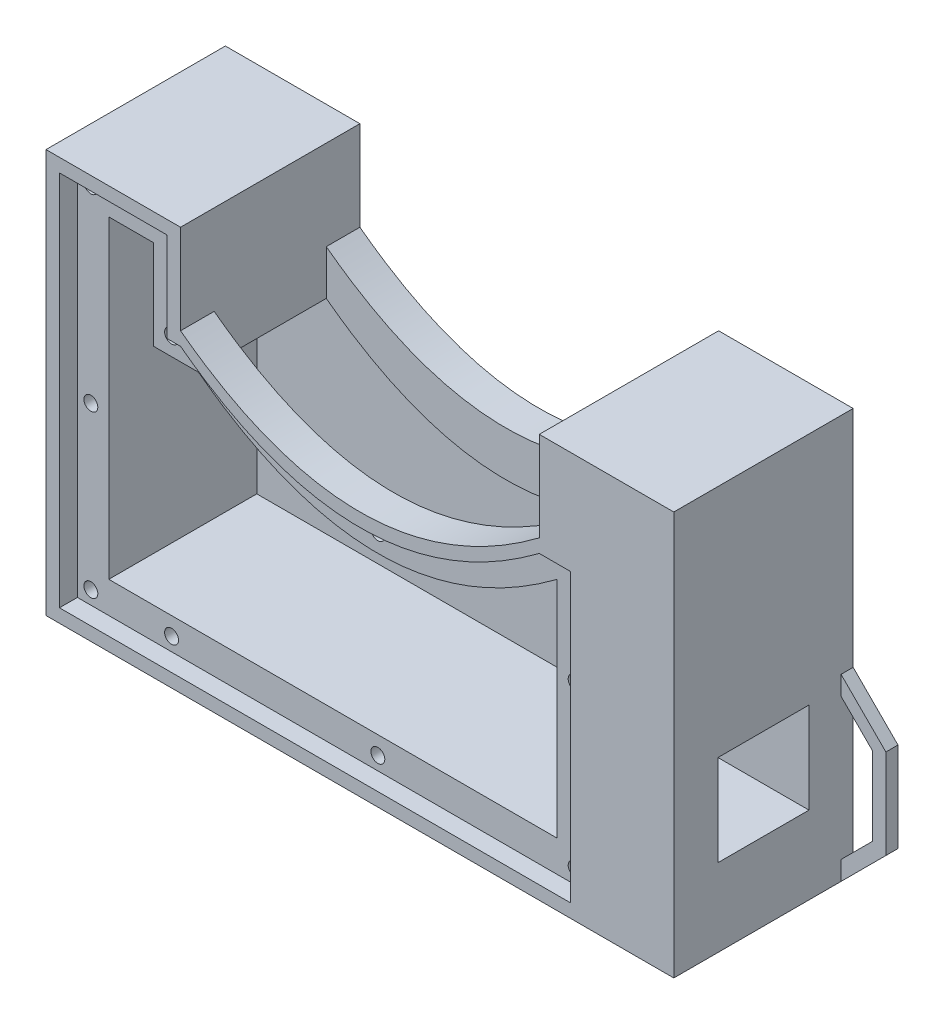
ISO-10303-21;
HEADER;
FILE_DESCRIPTION(('STEP AP214'),'2;1');
FILE_NAME('part.step','',(''),(''),'','','');
FILE_SCHEMA(('AUTOMOTIVE_DESIGN { 1 0 10303 214 1 1 1 1 }'));
ENDSEC;
DATA;
#1=APPLICATION_CONTEXT('core data for automotive mechanical design processes');
#2=APPLICATION_PROTOCOL_DEFINITION('international standard','automotive_design',2000,#1);
#3=PRODUCT_CONTEXT('',#1,'mechanical');
#4=PRODUCT('Part','Part','',(#3));
#5=PRODUCT_RELATED_PRODUCT_CATEGORY('part','',(#4));
#6=PRODUCT_DEFINITION_FORMATION('','',#4);
#7=PRODUCT_DEFINITION_CONTEXT('part definition',#1,'design');
#8=PRODUCT_DEFINITION('design','',#6,#7);
#9=PRODUCT_DEFINITION_SHAPE('','',#8);
#10=(LENGTH_UNIT() NAMED_UNIT(*) SI_UNIT(.MILLI.,.METRE.));
#11=(NAMED_UNIT(*) PLANE_ANGLE_UNIT() SI_UNIT($,.RADIAN.));
#12=(NAMED_UNIT(*) SI_UNIT($,.STERADIAN.) SOLID_ANGLE_UNIT());
#13=UNCERTAINTY_MEASURE_WITH_UNIT(LENGTH_MEASURE(1.E-05),#10,'distance_accuracy_value','');
#14=(GEOMETRIC_REPRESENTATION_CONTEXT(3) GLOBAL_UNCERTAINTY_ASSIGNED_CONTEXT((#13)) GLOBAL_UNIT_ASSIGNED_CONTEXT((#10,
#11,#12)) REPRESENTATION_CONTEXT('',''));
#15=CARTESIAN_POINT('',(0.,0.,0.));
#16=DIRECTION('',(0.,0.,1.));
#17=DIRECTION('',(1.,0.,0.));
#18=AXIS2_PLACEMENT_3D('',#15,#16,#17);
#19=CARTESIAN_POINT('',(110.,70.,40.));
#20=CARTESIAN_POINT('',(70.,40.,40.));
#21=CARTESIAN_POINT('',(30.,70.,40.));
#22=B_SPLINE_CURVE_WITH_KNOTS('',2,(#19,#20,#21),.UNSPECIFIED.,.F.,.F.,(3,3),(0.,1.),.UNSPECIFIED.);
#23=DIRECTION('',(0.,0.,-1.));
#24=VECTOR('',#23,1.);
#25=SURFACE_OF_LINEAR_EXTRUSION('',#22,#24);
#26=DIRECTION('',(0.,0.,-1.));
#27=VECTOR('',#26,1.);
#28=CARTESIAN_POINT('',(30.,70.,40.));
#29=LINE('',#28,#27);
#30=CARTESIAN_POINT('',(30.,69.9999999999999,7.50000000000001));
#31=VERTEX_POINT('',#30);
#32=CARTESIAN_POINT('',(30.,70.,0.));
#33=VERTEX_POINT('',#32);
#34=EDGE_CURVE('E489',#31,#33,#29,.T.);
#35=ORIENTED_EDGE('',*,*,#34,.F.);
#36=CARTESIAN_POINT('',(110.,70.,7.50000000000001));
#37=CARTESIAN_POINT('',(70.,40.,7.50000000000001));
#38=CARTESIAN_POINT('',(30.,70.,7.50000000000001));
#39=B_SPLINE_CURVE_WITH_KNOTS('',2,(#36,#37,#38),.UNSPECIFIED.,.F.,.F.,(3,3),(0.,1.),.UNSPECIFIED.);
#40=CARTESIAN_POINT('',(110.,70.,7.50000000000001));
#41=VERTEX_POINT('',#40);
#42=EDGE_CURVE('E559',#41,#31,#39,.T.);
#43=ORIENTED_EDGE('',*,*,#42,.F.);
#44=DIRECTION('',(0.,0.,-1.));
#45=VECTOR('',#44,1.);
#46=CARTESIAN_POINT('',(110.,70.,40.));
#47=LINE('',#46,#45);
#48=CARTESIAN_POINT('',(110.,70.,0.));
#49=VERTEX_POINT('',#48);
#50=EDGE_CURVE('E352',#41,#49,#47,.T.);
#51=ORIENTED_EDGE('',*,*,#50,.T.);
#52=CARTESIAN_POINT('',(110.,70.,0.));
#53=CARTESIAN_POINT('',(70.,40.,0.));
#54=CARTESIAN_POINT('',(30.,70.,0.));
#55=B_SPLINE_CURVE_WITH_KNOTS('',2,(#52,#53,#54),.UNSPECIFIED.,.F.,.F.,(3,3),(0.,1.),.UNSPECIFIED.);
#56=EDGE_CURVE('E512',#49,#33,#55,.T.);
#57=ORIENTED_EDGE('',*,*,#56,.T.);
#58=EDGE_LOOP('',(#35,#43,#51,#57));
#59=FACE_BOUND('',#58,.T.);
#60=ADVANCED_FACE('F38',(#59),#25,.F.);
#61=CARTESIAN_POINT('',(110.,60.,3.));
#62=CARTESIAN_POINT('',(70.,30.,3.));
#63=CARTESIAN_POINT('',(30.,60.,3.));
#64=B_SPLINE_CURVE_WITH_KNOTS('',2,(#61,#62,#63),.UNSPECIFIED.,.F.,.F.,(3,3),(0.,1.),.UNSPECIFIED.);
#65=DIRECTION('',(0.,0.,1.));
#66=VECTOR('',#65,1.);
#67=SURFACE_OF_LINEAR_EXTRUSION('',#64,#66);
#68=DIRECTION('',(0.,0.,1.));
#69=VECTOR('',#68,1.);
#70=CARTESIAN_POINT('',(110.,60.,3.));
#71=LINE('',#70,#69);
#72=CARTESIAN_POINT('',(110.,60.,3.));
#73=VERTEX_POINT('',#72);
#74=CARTESIAN_POINT('',(110.,60.,7.50000000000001));
#75=VERTEX_POINT('',#74);
#76=EDGE_CURVE('E571',#73,#75,#71,.T.);
#77=ORIENTED_EDGE('',*,*,#76,.T.);
#78=CARTESIAN_POINT('',(110.,60.,7.50000000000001));
#79=CARTESIAN_POINT('',(70.,30.,7.50000000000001));
#80=CARTESIAN_POINT('',(30.,60.,7.50000000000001));
#81=B_SPLINE_CURVE_WITH_KNOTS('',2,(#78,#79,#80),.UNSPECIFIED.,.F.,.F.,(3,3),(0.,1.),.UNSPECIFIED.);
#82=CARTESIAN_POINT('',(30.,60.,7.50000000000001));
#83=VERTEX_POINT('',#82);
#84=EDGE_CURVE('E575',#83,#75,#81,.F.);
#85=ORIENTED_EDGE('',*,*,#84,.F.);
#86=DIRECTION('',(0.,0.,1.));
#87=VECTOR('',#86,1.);
#88=CARTESIAN_POINT('',(30.,60.,3.));
#89=LINE('',#88,#87);
#90=CARTESIAN_POINT('',(30.,60.,3.));
#91=VERTEX_POINT('',#90);
#92=EDGE_CURVE('E570',#91,#83,#89,.T.);
#93=ORIENTED_EDGE('',*,*,#92,.F.);
#94=EDGE_CURVE('E438',#73,#91,#64,.T.);
#95=ORIENTED_EDGE('',*,*,#94,.F.);
#96=EDGE_LOOP('',(#77,#85,#93,#95));
#97=FACE_BOUND('',#96,.T.);
#98=ADVANCED_FACE('F457',(#97),#67,.F.);
#99=CARTESIAN_POINT('',(140.,0.,40.));
#100=DIRECTION('',(-1.,0.,0.));
#101=DIRECTION('',(0.,0.,1.));
#102=AXIS2_PLACEMENT_3D('',#99,#100,#101);
#103=PLANE('',#102);
#104=DIRECTION('',(0.,-1.,0.));
#105=VECTOR('',#104,1.);
#106=CARTESIAN_POINT('',(140.,0.,2.69999999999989));
#107=LINE('',#106,#105);
#108=CARTESIAN_POINT('',(140.,39.9999999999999,2.6999999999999));
#109=VERTEX_POINT('',#108);
#110=CARTESIAN_POINT('',(140.,35.7573593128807,2.6999999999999));
#111=VERTEX_POINT('',#110);
#112=EDGE_CURVE('E927',#109,#111,#107,.T.);
#113=ORIENTED_EDGE('',*,*,#112,.F.);
#114=DIRECTION('',(0.,0.,-1.));
#115=VECTOR('',#114,1.);
#116=CARTESIAN_POINT('',(140.,39.9999999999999,2.69999999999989));
#117=LINE('',#116,#115);
#118=CARTESIAN_POINT('',(140.,39.9999999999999,0.));
#119=VERTEX_POINT('',#118);
#120=EDGE_CURVE('E965',#109,#119,#117,.T.);
#121=ORIENTED_EDGE('',*,*,#120,.T.);
#122=DIRECTION('',(0.,1.,0.));
#123=VECTOR('',#122,1.);
#124=CARTESIAN_POINT('',(140.,0.,0.));
#125=LINE('',#124,#123);
#126=CARTESIAN_POINT('',(140.,90.,0.));
#127=VERTEX_POINT('',#126);
#128=EDGE_CURVE('E506',#119,#127,#125,.T.);
#129=ORIENTED_EDGE('',*,*,#128,.T.);
#130=DIRECTION('',(0.,0.,-1.));
#131=VECTOR('',#130,1.);
#132=CARTESIAN_POINT('',(140.,90.,40.));
#133=LINE('',#132,#131);
#134=CARTESIAN_POINT('',(140.,90.,40.));
#135=VERTEX_POINT('',#134);
#136=EDGE_CURVE('E355',#135,#127,#133,.T.);
#137=ORIENTED_EDGE('',*,*,#136,.F.);
#138=DIRECTION('',(0.,1.,0.));
#139=VECTOR('',#138,1.);
#140=CARTESIAN_POINT('',(140.,0.,40.));
#141=LINE('',#140,#139);
#142=CARTESIAN_POINT('',(140.,0.,40.));
#143=VERTEX_POINT('',#142);
#144=EDGE_CURVE('E539',#143,#135,#141,.T.);
#145=ORIENTED_EDGE('',*,*,#144,.F.);
#146=DIRECTION('',(0.,0.,-1.));
#147=VECTOR('',#146,1.);
#148=CARTESIAN_POINT('',(140.,0.,40.));
#149=LINE('',#148,#147);
#150=CARTESIAN_POINT('',(140.,0.,2.6999999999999));
#151=VERTEX_POINT('',#150);
#152=EDGE_CURVE('E363',#143,#151,#149,.T.);
#153=ORIENTED_EDGE('',*,*,#152,.T.);
#154=CARTESIAN_POINT('',(140.,4.24264068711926,2.6999999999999));
#155=VERTEX_POINT('',#154);
#156=EDGE_CURVE('E931',#155,#151,#107,.T.);
#157=ORIENTED_EDGE('',*,*,#156,.F.);
#158=DIRECTION('',(0.,0.,-1.));
#159=VECTOR('',#158,1.);
#160=CARTESIAN_POINT('',(140.,4.24264068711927,2.69999999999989));
#161=LINE('',#160,#159);
#162=CARTESIAN_POINT('',(140.,4.24264068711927,0.));
#163=VERTEX_POINT('',#162);
#164=EDGE_CURVE('E954',#155,#163,#161,.T.);
#165=ORIENTED_EDGE('',*,*,#164,.T.);
#166=CARTESIAN_POINT('',(140.,35.7573593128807,0.));
#167=VERTEX_POINT('',#166);
#168=EDGE_CURVE('E508',#163,#167,#125,.T.);
#169=ORIENTED_EDGE('',*,*,#168,.T.);
#170=DIRECTION('',(0.,0.,-1.));
#171=VECTOR('',#170,1.);
#172=CARTESIAN_POINT('',(140.,35.7573593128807,2.69999999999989));
#173=LINE('',#172,#171);
#174=EDGE_CURVE('E968',#111,#167,#173,.T.);
#175=ORIENTED_EDGE('',*,*,#174,.F.);
#176=EDGE_LOOP('',(#113,#121,#129,#137,#145,#153,#157,#165,#169,#175));
#177=FACE_BOUND('',#176,.T.);
#178=DIRECTION('',(0.,0.,-1.));
#179=VECTOR('',#178,1.);
#180=CARTESIAN_POINT('',(140.,17.35,30.15));
#181=LINE('',#180,#179);
#182=CARTESIAN_POINT('',(140.,17.35,30.15));
#183=VERTEX_POINT('',#182);
#184=CARTESIAN_POINT('',(140.,17.35,9.85));
#185=VERTEX_POINT('',#184);
#186=EDGE_CURVE('E410',#183,#185,#181,.T.);
#187=ORIENTED_EDGE('',*,*,#186,.F.);
#188=DIRECTION('',(0.,-1.,0.));
#189=VECTOR('',#188,1.);
#190=CARTESIAN_POINT('',(140.,37.65,30.15));
#191=LINE('',#190,#189);
#192=CARTESIAN_POINT('',(140.,37.65,30.15));
#193=VERTEX_POINT('',#192);
#194=EDGE_CURVE('E393',#193,#183,#191,.T.);
#195=ORIENTED_EDGE('',*,*,#194,.F.);
#196=DIRECTION('',(0.,0.,1.));
#197=VECTOR('',#196,1.);
#198=CARTESIAN_POINT('',(140.,37.65,30.15));
#199=LINE('',#198,#197);
#200=CARTESIAN_POINT('',(140.,37.65,9.85));
#201=VERTEX_POINT('',#200);
#202=EDGE_CURVE('E399',#201,#193,#199,.T.);
#203=ORIENTED_EDGE('',*,*,#202,.F.);
#204=DIRECTION('',(0.,1.,0.));
#205=VECTOR('',#204,1.);
#206=CARTESIAN_POINT('',(140.,37.65,9.85));
#207=LINE('',#206,#205);
#208=EDGE_CURVE('E413',#185,#201,#207,.T.);
#209=ORIENTED_EDGE('',*,*,#208,.F.);
#210=EDGE_LOOP('',(#187,#195,#203,#209));
#211=FACE_BOUND('',#210,.T.);
#212=ADVANCED_FACE('F805',(#177,#211),#103,.F.);
#213=CARTESIAN_POINT('',(30.,90.,40.));
#214=DIRECTION('',(-1.,0.,0.));
#215=DIRECTION('',(0.,-1.,0.));
#216=AXIS2_PLACEMENT_3D('',#213,#214,#215);
#217=PLANE('',#216);
#218=DIRECTION('',(0.,1.,0.));
#219=VECTOR('',#218,1.);
#220=CARTESIAN_POINT('',(30.,90.,0.));
#221=LINE('',#220,#219);
#222=CARTESIAN_POINT('',(30.,90.,0.));
#223=VERTEX_POINT('',#222);
#224=EDGE_CURVE('E492',#33,#223,#221,.T.);
#225=ORIENTED_EDGE('',*,*,#224,.T.);
#226=DIRECTION('',(0.,0.,-1.));
#227=VECTOR('',#226,1.);
#228=CARTESIAN_POINT('',(30.,90.,40.));
#229=LINE('',#228,#227);
#230=CARTESIAN_POINT('',(30.,90.,40.));
#231=VERTEX_POINT('',#230);
#232=EDGE_CURVE('E46',#231,#223,#229,.T.);
#233=ORIENTED_EDGE('',*,*,#232,.F.);
#234=DIRECTION('',(0.,1.,0.));
#235=VECTOR('',#234,1.);
#236=CARTESIAN_POINT('',(30.,90.,40.));
#237=LINE('',#236,#235);
#238=CARTESIAN_POINT('',(30.,70.,40.));
#239=VERTEX_POINT('',#238);
#240=EDGE_CURVE('E516',#239,#231,#237,.T.);
#241=ORIENTED_EDGE('',*,*,#240,.F.);
#242=CARTESIAN_POINT('',(30.,70.,32.5));
#243=VERTEX_POINT('',#242);
#244=EDGE_CURVE('E357',#239,#243,#29,.T.);
#245=ORIENTED_EDGE('',*,*,#244,.T.);
#246=DIRECTION('',(0.,1.,0.));
#247=VECTOR('',#246,1.);
#248=CARTESIAN_POINT('',(30.,-0.001000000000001,32.5));
#249=LINE('',#248,#247);
#250=CARTESIAN_POINT('',(30.,60.,32.5));
#251=VERTEX_POINT('',#250);
#252=EDGE_CURVE('E53',#251,#243,#249,.T.);
#253=ORIENTED_EDGE('',*,*,#252,.F.);
#254=DIRECTION('',(0.,0.,1.));
#255=VECTOR('',#254,1.);
#256=CARTESIAN_POINT('',(30.,60.,3.));
#257=LINE('',#256,#255);
#258=EDGE_CURVE('E557',#83,#251,#257,.T.);
#259=ORIENTED_EDGE('',*,*,#258,.F.);
#260=DIRECTION('',(0.,1.,0.));
#261=VECTOR('',#260,1.);
#262=CARTESIAN_POINT('',(30.,-0.001000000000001,7.50000000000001));
#263=LINE('',#262,#261);
#264=EDGE_CURVE('E553',#83,#31,#263,.T.);
#265=ORIENTED_EDGE('',*,*,#264,.T.);
#266=ORIENTED_EDGE('',*,*,#34,.T.);
#267=EDGE_LOOP('',(#225,#233,#241,#245,#253,#259,#265,#266));
#268=FACE_BOUND('',#267,.T.);
#269=ADVANCED_FACE('F40',(#268),#217,.F.);
#270=CARTESIAN_POINT('',(30.,90.,40.));
#271=DIRECTION('',(0.,-1.,0.));
#272=DIRECTION('',(1.,0.,0.));
#273=AXIS2_PLACEMENT_3D('',#270,#271,#272);
#274=PLANE('',#273);
#275=DIRECTION('',(-1.,0.,0.));
#276=VECTOR('',#275,1.);
#277=CARTESIAN_POINT('',(30.,90.,0.));
#278=LINE('',#277,#276);
#279=CARTESIAN_POINT('',(0.,90.,0.));
#280=VERTEX_POINT('',#279);
#281=EDGE_CURVE('E498',#223,#280,#278,.T.);
#282=ORIENTED_EDGE('',*,*,#281,.T.);
#283=DIRECTION('',(0.,0.,-1.));
#284=VECTOR('',#283,1.);
#285=CARTESIAN_POINT('',(0.,90.,40.));
#286=LINE('',#285,#284);
#287=CARTESIAN_POINT('',(0.,90.,40.));
#288=VERTEX_POINT('',#287);
#289=EDGE_CURVE('E369',#288,#280,#286,.T.);
#290=ORIENTED_EDGE('',*,*,#289,.F.);
#291=DIRECTION('',(-1.,0.,0.));
#292=VECTOR('',#291,1.);
#293=CARTESIAN_POINT('',(30.,90.,40.));
#294=LINE('',#293,#292);
#295=EDGE_CURVE('E525',#231,#288,#294,.T.);
#296=ORIENTED_EDGE('',*,*,#295,.F.);
#297=ORIENTED_EDGE('',*,*,#232,.T.);
#298=EDGE_LOOP('',(#282,#290,#296,#297));
#299=FACE_BOUND('',#298,.T.);
#300=ADVANCED_FACE('F1026',(#299),#274,.F.);
#301=CARTESIAN_POINT('',(0.,90.,40.));
#302=DIRECTION('',(1.,0.,0.));
#303=DIRECTION('',(0.,1.,0.));
#304=AXIS2_PLACEMENT_3D('',#301,#302,#303);
#305=PLANE('',#304);
#306=DIRECTION('',(0.,-1.,0.));
#307=VECTOR('',#306,1.);
#308=CARTESIAN_POINT('',(0.,90.,0.));
#309=LINE('',#308,#307);
#310=CARTESIAN_POINT('',(0.,35.7573593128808,0.));
#311=VERTEX_POINT('',#310);
#312=CARTESIAN_POINT('',(0.,4.24264068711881,0.));
#313=VERTEX_POINT('',#312);
#314=EDGE_CURVE('E501',#311,#313,#309,.T.);
#315=ORIENTED_EDGE('',*,*,#314,.T.);
#316=DIRECTION('',(0.,0.,-1.));
#317=VECTOR('',#316,1.);
#318=CARTESIAN_POINT('',(0.,4.24264068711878,2.69999999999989));
#319=LINE('',#318,#317);
#320=CARTESIAN_POINT('',(0.,4.24264068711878,2.6999999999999));
#321=VERTEX_POINT('',#320);
#322=EDGE_CURVE('E915',#321,#313,#319,.T.);
#323=ORIENTED_EDGE('',*,*,#322,.F.);
#324=DIRECTION('',(0.,1.,0.));
#325=VECTOR('',#324,1.);
#326=CARTESIAN_POINT('',(0.,0.,2.69999999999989));
#327=LINE('',#326,#325);
#328=CARTESIAN_POINT('',(0.,0.,2.69999999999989));
#329=VERTEX_POINT('',#328);
#330=EDGE_CURVE('E868',#329,#321,#327,.T.);
#331=ORIENTED_EDGE('',*,*,#330,.F.);
#332=DIRECTION('',(0.,0.,-1.));
#333=VECTOR('',#332,1.);
#334=CARTESIAN_POINT('',(0.,0.,40.));
#335=LINE('',#334,#333);
#336=CARTESIAN_POINT('',(0.,0.,40.));
#337=VERTEX_POINT('',#336);
#338=EDGE_CURVE('E366',#337,#329,#335,.T.);
#339=ORIENTED_EDGE('',*,*,#338,.F.);
#340=DIRECTION('',(0.,-1.,0.));
#341=VECTOR('',#340,1.);
#342=CARTESIAN_POINT('',(0.,90.,40.));
#343=LINE('',#342,#341);
#344=EDGE_CURVE('E530',#288,#337,#343,.T.);
#345=ORIENTED_EDGE('',*,*,#344,.F.);
#346=ORIENTED_EDGE('',*,*,#289,.T.);
#347=CARTESIAN_POINT('',(0.,40.,0.));
#348=VERTEX_POINT('',#347);
#349=EDGE_CURVE('E502',#280,#348,#309,.T.);
#350=ORIENTED_EDGE('',*,*,#349,.T.);
#351=DIRECTION('',(0.,0.,-1.));
#352=VECTOR('',#351,1.);
#353=CARTESIAN_POINT('',(0.,40.,2.69999999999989));
#354=LINE('',#353,#352);
#355=CARTESIAN_POINT('',(0.,40.,2.6999999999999));
#356=VERTEX_POINT('',#355);
#357=EDGE_CURVE('E903',#356,#348,#354,.T.);
#358=ORIENTED_EDGE('',*,*,#357,.F.);
#359=CARTESIAN_POINT('',(0.,35.7573593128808,2.6999999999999));
#360=VERTEX_POINT('',#359);
#361=EDGE_CURVE('E872',#360,#356,#327,.T.);
#362=ORIENTED_EDGE('',*,*,#361,.F.);
#363=DIRECTION('',(0.,0.,-1.));
#364=VECTOR('',#363,1.);
#365=CARTESIAN_POINT('',(0.,35.7573593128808,2.69999999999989));
#366=LINE('',#365,#364);
#367=EDGE_CURVE('E900',#360,#311,#366,.T.);
#368=ORIENTED_EDGE('',*,*,#367,.T.);
#369=EDGE_LOOP('',(#315,#323,#331,#339,#345,#346,#350,#358,#362,#368));
#370=FACE_BOUND('',#369,.T.);
#371=ADVANCED_FACE('F1021',(#370),#305,.F.);
#372=CARTESIAN_POINT('',(0.,0.,40.));
#373=DIRECTION('',(0.,1.,0.));
#374=DIRECTION('',(0.,0.,1.));
#375=AXIS2_PLACEMENT_3D('',#372,#373,#374);
#376=PLANE('',#375);
#377=DIRECTION('',(1.,0.,0.));
#378=VECTOR('',#377,1.);
#379=CARTESIAN_POINT('',(0.,0.,0.));
#380=LINE('',#379,#378);
#381=CARTESIAN_POINT('',(0.,0.,0.));
#382=VERTEX_POINT('',#381);
#383=CARTESIAN_POINT('',(140.,0.,0.));
#384=VERTEX_POINT('',#383);
#385=EDGE_CURVE('E504',#382,#384,#380,.T.);
#386=ORIENTED_EDGE('',*,*,#385,.T.);
#387=DIRECTION('',(0.,0.,-1.));
#388=VECTOR('',#387,1.);
#389=CARTESIAN_POINT('',(140.,0.,2.69999999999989));
#390=LINE('',#389,#388);
#391=EDGE_CURVE('E958',#151,#384,#390,.T.);
#392=ORIENTED_EDGE('',*,*,#391,.F.);
#393=ORIENTED_EDGE('',*,*,#152,.F.);
#394=DIRECTION('',(1.,0.,0.));
#395=VECTOR('',#394,1.);
#396=CARTESIAN_POINT('',(0.,0.,40.));
#397=LINE('',#396,#395);
#398=EDGE_CURVE('E537',#337,#143,#397,.T.);
#399=ORIENTED_EDGE('',*,*,#398,.F.);
#400=ORIENTED_EDGE('',*,*,#338,.T.);
#401=DIRECTION('',(0.,0.,-1.));
#402=VECTOR('',#401,1.);
#403=CARTESIAN_POINT('',(0.,0.,2.69999999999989));
#404=LINE('',#403,#402);
#405=EDGE_CURVE('E912',#329,#382,#404,.T.);
#406=ORIENTED_EDGE('',*,*,#405,.T.);
#407=EDGE_LOOP('',(#386,#392,#393,#399,#400,#406));
#408=FACE_BOUND('',#407,.T.);
#409=ADVANCED_FACE('F1017',(#408),#376,.F.);
#410=CARTESIAN_POINT('',(140.,90.,40.));
#411=DIRECTION('',(0.,-1.,0.));
#412=DIRECTION('',(0.,0.,-1.));
#413=AXIS2_PLACEMENT_3D('',#410,#411,#412);
#414=PLANE('',#413);
#415=DIRECTION('',(-1.,0.,0.));
#416=VECTOR('',#415,1.);
#417=CARTESIAN_POINT('',(140.,90.,0.));
#418=LINE('',#417,#416);
#419=CARTESIAN_POINT('',(110.,90.,0.));
#420=VERTEX_POINT('',#419);
#421=EDGE_CURVE('E509',#127,#420,#418,.T.);
#422=ORIENTED_EDGE('',*,*,#421,.T.);
#423=DIRECTION('',(0.,0.,-1.));
#424=VECTOR('',#423,1.);
#425=CARTESIAN_POINT('',(110.,90.,40.));
#426=LINE('',#425,#424);
#427=CARTESIAN_POINT('',(110.,90.,40.));
#428=VERTEX_POINT('',#427);
#429=EDGE_CURVE('E351',#428,#420,#426,.T.);
#430=ORIENTED_EDGE('',*,*,#429,.F.);
#431=DIRECTION('',(-1.,0.,0.));
#432=VECTOR('',#431,1.);
#433=CARTESIAN_POINT('',(140.,90.,40.));
#434=LINE('',#433,#432);
#435=EDGE_CURVE('E540',#135,#428,#434,.T.);
#436=ORIENTED_EDGE('',*,*,#435,.F.);
#437=ORIENTED_EDGE('',*,*,#136,.T.);
#438=EDGE_LOOP('',(#422,#430,#436,#437));
#439=FACE_BOUND('',#438,.T.);
#440=ADVANCED_FACE('F1013',(#439),#414,.F.);
#441=CARTESIAN_POINT('',(110.,90.,40.));
#442=DIRECTION('',(1.,0.,0.));
#443=DIRECTION('',(0.,0.,-1.));
#444=AXIS2_PLACEMENT_3D('',#441,#442,#443);
#445=PLANE('',#444);
#446=DIRECTION('',(0.,-1.,0.));
#447=VECTOR('',#446,1.);
#448=CARTESIAN_POINT('',(110.,90.,0.));
#449=LINE('',#448,#447);
#450=EDGE_CURVE('E511',#420,#49,#449,.T.);
#451=ORIENTED_EDGE('',*,*,#450,.T.);
#452=ORIENTED_EDGE('',*,*,#50,.F.);
#453=DIRECTION('',(0.,1.,0.));
#454=VECTOR('',#453,1.);
#455=CARTESIAN_POINT('',(110.,-0.001000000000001,7.50000000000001));
#456=LINE('',#455,#454);
#457=EDGE_CURVE('E339',#75,#41,#456,.T.);
#458=ORIENTED_EDGE('',*,*,#457,.F.);
#459=ORIENTED_EDGE('',*,*,#76,.F.);
#460=DIRECTION('',(0.,1.,0.));
#461=VECTOR('',#460,1.);
#462=CARTESIAN_POINT('',(110.,10.,3.));
#463=LINE('',#462,#461);
#464=CARTESIAN_POINT('',(110.,10.,3.));
#465=VERTEX_POINT('',#464);
#466=EDGE_CURVE('E435',#465,#73,#463,.T.);
#467=ORIENTED_EDGE('',*,*,#466,.F.);
#468=DIRECTION('',(0.,0.,1.));
#469=VECTOR('',#468,1.);
#470=CARTESIAN_POINT('',(110.,10.,3.));
#471=LINE('',#470,#469);
#472=CARTESIAN_POINT('',(110.,10.,36.));
#473=VERTEX_POINT('',#472);
#474=EDGE_CURVE('E816',#465,#473,#471,.T.);
#475=ORIENTED_EDGE('',*,*,#474,.T.);
#476=DIRECTION('',(0.,1.,0.));
#477=VECTOR('',#476,1.);
#478=CARTESIAN_POINT('',(110.,10.,36.));
#479=LINE('',#478,#477);
#480=CARTESIAN_POINT('',(110.,60.,36.));
#481=VERTEX_POINT('',#480);
#482=EDGE_CURVE('E837',#473,#481,#479,.T.);
#483=ORIENTED_EDGE('',*,*,#482,.T.);
#484=CARTESIAN_POINT('',(110.,60.,32.5));
#485=VERTEX_POINT('',#484);
#486=EDGE_CURVE('E338',#485,#481,#71,.T.);
#487=ORIENTED_EDGE('',*,*,#486,.F.);
#488=DIRECTION('',(0.,1.,0.));
#489=VECTOR('',#488,1.);
#490=CARTESIAN_POINT('',(110.,-0.001000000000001,32.5));
#491=LINE('',#490,#489);
#492=CARTESIAN_POINT('',(110.,70.,32.5));
#493=VERTEX_POINT('',#492);
#494=EDGE_CURVE('E58',#485,#493,#491,.T.);
#495=ORIENTED_EDGE('',*,*,#494,.T.);
#496=CARTESIAN_POINT('',(110.,70.,40.));
#497=VERTEX_POINT('',#496);
#498=EDGE_CURVE('E335',#497,#493,#47,.T.);
#499=ORIENTED_EDGE('',*,*,#498,.F.);
#500=DIRECTION('',(0.,-1.,0.));
#501=VECTOR('',#500,1.);
#502=CARTESIAN_POINT('',(110.,90.,40.));
#503=LINE('',#502,#501);
#504=EDGE_CURVE('E490',#428,#497,#503,.T.);
#505=ORIENTED_EDGE('',*,*,#504,.F.);
#506=ORIENTED_EDGE('',*,*,#429,.T.);
#507=EDGE_LOOP('',(#451,#452,#458,#459,#467,#475,#483,#487,#495,#499,#505,#506));
#508=FACE_BOUND('',#507,.T.);
#509=CARTESIAN_POINT('',(110.,19.75,27.9229960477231));
#510=DIRECTION('',(1.,0.,0.));
#511=DIRECTION('',(0.,0.,-1.));
#512=AXIS2_PLACEMENT_3D('',#509,#510,#511);
#513=CIRCLE('',#512,1.);
#514=CARTESIAN_POINT('',(110.,19.75,26.9229960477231));
#515=VERTEX_POINT('',#514);
#516=EDGE_CURVE('E987',#515,#515,#513,.F.);
#517=ORIENTED_EDGE('',*,*,#516,.F.);
#518=EDGE_LOOP('',(#517));
#519=FACE_BOUND('',#518,.T.);
#520=CARTESIAN_POINT('',(110.,19.75,12.4229960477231));
#521=DIRECTION('',(1.,0.,0.));
#522=DIRECTION('',(0.,0.,-1.));
#523=AXIS2_PLACEMENT_3D('',#520,#521,#522);
#524=CIRCLE('',#523,1.);
#525=CARTESIAN_POINT('',(110.,19.75,11.4229960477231));
#526=VERTEX_POINT('',#525);
#527=EDGE_CURVE('E981',#526,#526,#524,.F.);
#528=ORIENTED_EDGE('',*,*,#527,.F.);
#529=EDGE_LOOP('',(#528));
#530=FACE_BOUND('',#529,.T.);
#531=CARTESIAN_POINT('',(110.,35.25,12.4229960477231));
#532=DIRECTION('',(1.,0.,0.));
#533=DIRECTION('',(0.,0.,-1.));
#534=AXIS2_PLACEMENT_3D('',#531,#532,#533);
#535=CIRCLE('',#534,1.);
#536=CARTESIAN_POINT('',(110.,35.25,11.4229960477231));
#537=VERTEX_POINT('',#536);
#538=EDGE_CURVE('E980',#537,#537,#535,.F.);
#539=ORIENTED_EDGE('',*,*,#538,.F.);
#540=EDGE_LOOP('',(#539));
#541=FACE_BOUND('',#540,.T.);
#542=CARTESIAN_POINT('',(110.,35.25,27.9229960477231));
#543=DIRECTION('',(1.,0.,0.));
#544=DIRECTION('',(0.,0.,-1.));
#545=AXIS2_PLACEMENT_3D('',#542,#543,#544);
#546=CIRCLE('',#545,1.);
#547=CARTESIAN_POINT('',(110.,35.25,26.9229960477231));
#548=VERTEX_POINT('',#547);
#549=EDGE_CURVE('E383',#548,#548,#546,.F.);
#550=ORIENTED_EDGE('',*,*,#549,.F.);
#551=EDGE_LOOP('',(#550));
#552=FACE_BOUND('',#551,.T.);
#553=CARTESIAN_POINT('',(110.,27.5,20.));
#554=DIRECTION('',(1.,0.,0.));
#555=DIRECTION('',(0.,0.,-1.));
#556=AXIS2_PLACEMENT_3D('',#553,#554,#555);
#557=CIRCLE('',#556,4.);
#558=CARTESIAN_POINT('',(110.,27.5,16.));
#559=VERTEX_POINT('',#558);
#560=EDGE_CURVE('E373',#559,#559,#557,.T.);
#561=ORIENTED_EDGE('',*,*,#560,.T.);
#562=EDGE_LOOP('',(#561));
#563=FACE_BOUND('',#562,.T.);
#564=ADVANCED_FACE('F331',(#508,#519,#530,#541,#552,#563),#445,.F.);
#565=ORIENTED_EDGE('',*,*,#498,.T.);
#566=CARTESIAN_POINT('',(110.,70.,32.5));
#567=CARTESIAN_POINT('',(70.,40.,32.5));
#568=CARTESIAN_POINT('',(30.,70.,32.5));
#569=B_SPLINE_CURVE_WITH_KNOTS('',2,(#566,#567,#568),.UNSPECIFIED.,.F.,.F.,(3,3),(0.,1.),.UNSPECIFIED.);
#570=EDGE_CURVE('E341',#243,#493,#569,.F.);
#571=ORIENTED_EDGE('',*,*,#570,.F.);
#572=ORIENTED_EDGE('',*,*,#244,.F.);
#573=EDGE_CURVE('E350',#497,#239,#22,.T.);
#574=ORIENTED_EDGE('',*,*,#573,.F.);
#575=EDGE_LOOP('',(#565,#571,#572,#574));
#576=FACE_BOUND('',#575,.T.);
#577=ADVANCED_FACE('F349',(#576),#25,.F.);
#578=CARTESIAN_POINT('',(70.,55.,40.));
#579=DIRECTION('',(0.,0.,-1.));
#580=DIRECTION('',(-1.,0.,0.));
#581=AXIS2_PLACEMENT_3D('',#578,#579,#580);
#582=PLANE('',#581);
#583=DIRECTION('',(-1.,0.,0.));
#584=VECTOR('',#583,1.);
#585=CARTESIAN_POINT('',(30.,67.,40.));
#586=LINE('',#585,#584);
#587=CARTESIAN_POINT('',(30.,67.,40.));
#588=VERTEX_POINT('',#587);
#589=CARTESIAN_POINT('',(27.,67.,40.));
#590=VERTEX_POINT('',#589);
#591=EDGE_CURVE('E1733',#588,#590,#586,.T.);
#592=ORIENTED_EDGE('',*,*,#591,.F.);
#593=CARTESIAN_POINT('',(110.,67.,40.));
#594=CARTESIAN_POINT('',(70.,37.,40.));
#595=CARTESIAN_POINT('',(30.,67.,40.));
#596=B_SPLINE_CURVE_WITH_KNOTS('',2,(#593,#594,#595),.UNSPECIFIED.,.F.,.F.,(3,3),(0.,1.),.UNSPECIFIED.);
#597=CARTESIAN_POINT('',(110.,67.,40.));
#598=VERTEX_POINT('',#597);
#599=EDGE_CURVE('E665',#598,#588,#596,.T.);
#600=ORIENTED_EDGE('',*,*,#599,.F.);
#601=DIRECTION('',(-1.,0.,0.));
#602=VECTOR('',#601,1.);
#603=CARTESIAN_POINT('',(117.,67.,40.));
#604=LINE('',#603,#602);
#605=CARTESIAN_POINT('',(117.,67.,40.));
#606=VERTEX_POINT('',#605);
#607=EDGE_CURVE('E675',#606,#598,#604,.T.);
#608=ORIENTED_EDGE('',*,*,#607,.F.);
#609=DIRECTION('',(0.,1.,0.));
#610=VECTOR('',#609,1.);
#611=CARTESIAN_POINT('',(117.,3.,40.));
#612=LINE('',#611,#610);
#613=CARTESIAN_POINT('',(117.,3.,40.));
#614=VERTEX_POINT('',#613);
#615=EDGE_CURVE('E1750',#614,#606,#612,.T.);
#616=ORIENTED_EDGE('',*,*,#615,.F.);
#617=DIRECTION('',(1.,0.,0.));
#618=VECTOR('',#617,1.);
#619=CARTESIAN_POINT('',(3.,3.,40.));
#620=LINE('',#619,#618);
#621=CARTESIAN_POINT('',(3.,3.,40.));
#622=VERTEX_POINT('',#621);
#623=EDGE_CURVE('E1747',#622,#614,#620,.T.);
#624=ORIENTED_EDGE('',*,*,#623,.F.);
#625=DIRECTION('',(0.,-1.,0.));
#626=VECTOR('',#625,1.);
#627=CARTESIAN_POINT('',(2.99999999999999,87.,40.));
#628=LINE('',#627,#626);
#629=CARTESIAN_POINT('',(2.99999999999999,87.,40.));
#630=VERTEX_POINT('',#629);
#631=EDGE_CURVE('E1744',#630,#622,#628,.T.);
#632=ORIENTED_EDGE('',*,*,#631,.F.);
#633=DIRECTION('',(-1.,0.,0.));
#634=VECTOR('',#633,1.);
#635=CARTESIAN_POINT('',(27.,87.,40.));
#636=LINE('',#635,#634);
#637=CARTESIAN_POINT('',(27.,87.,40.));
#638=VERTEX_POINT('',#637);
#639=EDGE_CURVE('E1741',#638,#630,#636,.T.);
#640=ORIENTED_EDGE('',*,*,#639,.F.);
#641=DIRECTION('',(0.,1.,0.));
#642=VECTOR('',#641,1.);
#643=CARTESIAN_POINT('',(27.,67.,40.));
#644=LINE('',#643,#642);
#645=EDGE_CURVE('E1738',#590,#638,#644,.T.);
#646=ORIENTED_EDGE('',*,*,#645,.F.);
#647=EDGE_LOOP('',(#592,#600,#608,#616,#624,#632,#640,#646));
#648=FACE_BOUND('',#647,.T.);
#649=ORIENTED_EDGE('',*,*,#240,.T.);
#650=ORIENTED_EDGE('',*,*,#295,.T.);
#651=ORIENTED_EDGE('',*,*,#344,.T.);
#652=ORIENTED_EDGE('',*,*,#398,.T.);
#653=ORIENTED_EDGE('',*,*,#144,.T.);
#654=ORIENTED_EDGE('',*,*,#435,.T.);
#655=ORIENTED_EDGE('',*,*,#504,.T.);
#656=ORIENTED_EDGE('',*,*,#573,.T.);
#657=EDGE_LOOP('',(#649,#650,#651,#652,#653,#654,#655,#656));
#658=FACE_BOUND('',#657,.T.);
#659=ADVANCED_FACE('F473',(#648,#658),#582,.F.);
#660=CARTESIAN_POINT('',(70.,55.,0.));
#661=DIRECTION('',(0.,0.,-1.));
#662=DIRECTION('',(-1.,0.,0.));
#663=AXIS2_PLACEMENT_3D('',#660,#661,#662);
#664=PLANE('',#663);
#665=CARTESIAN_POINT('',(15.,75.,0.));
#666=DIRECTION('',(0.,0.,-1.));
#667=DIRECTION('',(-1.,0.,0.));
#668=AXIS2_PLACEMENT_3D('',#665,#666,#667);
#669=CIRCLE('',#668,2.5);
#670=CARTESIAN_POINT('',(17.5,75.,0.));
#671=VERTEX_POINT('',#670);
#672=EDGE_CURVE('E581',#671,#671,#669,.F.);
#673=ORIENTED_EDGE('',*,*,#672,.T.);
#674=EDGE_LOOP('',(#673));
#675=FACE_BOUND('',#674,.T.);
#676=DIRECTION('',(-0.707106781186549,-0.707106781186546,0.));
#677=VECTOR('',#676,1.);
#678=CARTESIAN_POINT('',(-20.,20.0000000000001,0.));
#679=LINE('',#678,#677);
#680=CARTESIAN_POINT('',(-10.,30.,0.));
#681=VERTEX_POINT('',#680);
#682=EDGE_CURVE('E893',#348,#681,#679,.T.);
#683=ORIENTED_EDGE('',*,*,#682,.F.);
#684=ORIENTED_EDGE('',*,*,#349,.F.);
#685=ORIENTED_EDGE('',*,*,#281,.F.);
#686=ORIENTED_EDGE('',*,*,#224,.F.);
#687=ORIENTED_EDGE('',*,*,#56,.F.);
#688=ORIENTED_EDGE('',*,*,#450,.F.);
#689=ORIENTED_EDGE('',*,*,#421,.F.);
#690=ORIENTED_EDGE('',*,*,#128,.F.);
#691=DIRECTION('',(0.707106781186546,-0.707106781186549,0.));
#692=VECTOR('',#691,1.);
#693=CARTESIAN_POINT('',(90.0000000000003,89.9999999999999,0.));
#694=LINE('',#693,#692);
#695=CARTESIAN_POINT('',(150.,29.9999999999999,0.));
#696=VERTEX_POINT('',#695);
#697=EDGE_CURVE('E946',#119,#696,#694,.T.);
#698=ORIENTED_EDGE('',*,*,#697,.T.);
#699=DIRECTION('',(0.,-1.,0.));
#700=VECTOR('',#699,1.);
#701=CARTESIAN_POINT('',(150.,-2.08166817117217E-13,0.));
#702=LINE('',#701,#700);
#703=CARTESIAN_POINT('',(150.,9.99999999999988,0.));
#704=VERTEX_POINT('',#703);
#705=EDGE_CURVE('E949',#696,#704,#702,.T.);
#706=ORIENTED_EDGE('',*,*,#705,.T.);
#707=DIRECTION('',(-0.707106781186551,-0.707106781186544,0.));
#708=VECTOR('',#707,1.);
#709=CARTESIAN_POINT('',(69.9999999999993,-70.,0.));
#710=LINE('',#709,#708);
#711=EDGE_CURVE('E923',#704,#384,#710,.T.);
#712=ORIENTED_EDGE('',*,*,#711,.T.);
#713=ORIENTED_EDGE('',*,*,#385,.F.);
#714=DIRECTION('',(0.707106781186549,-0.707106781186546,0.));
#715=VECTOR('',#714,1.);
#716=CARTESIAN_POINT('',(0.,0.,0.));
#717=LINE('',#716,#715);
#718=CARTESIAN_POINT('',(-10.,9.99999999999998,0.));
#719=VERTEX_POINT('',#718);
#720=EDGE_CURVE('E888',#719,#382,#717,.T.);
#721=ORIENTED_EDGE('',*,*,#720,.F.);
#722=DIRECTION('',(0.,-1.,0.));
#723=VECTOR('',#722,1.);
#724=CARTESIAN_POINT('',(-10.,0.,0.));
#725=LINE('',#724,#723);
#726=EDGE_CURVE('E891',#681,#719,#725,.T.);
#727=ORIENTED_EDGE('',*,*,#726,.F.);
#728=EDGE_LOOP('',(#683,#684,#685,#686,#687,#688,#689,#690,#698,#706,#712,#713,#721,#727));
#729=FACE_BOUND('',#728,.T.);
#730=ORIENTED_EDGE('',*,*,#168,.F.);
#731=DIRECTION('',(-0.70710678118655,-0.707106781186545,0.));
#732=VECTOR('',#731,1.);
#733=CARTESIAN_POINT('',(67.8786796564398,-67.8786796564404,0.));
#734=LINE('',#733,#732);
#735=CARTESIAN_POINT('',(147.,11.2426406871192,0.));
#736=VERTEX_POINT('',#735);
#737=EDGE_CURVE('E899',#736,#163,#734,.T.);
#738=ORIENTED_EDGE('',*,*,#737,.F.);
#739=DIRECTION('',(0.,-1.,0.));
#740=VECTOR('',#739,1.);
#741=CARTESIAN_POINT('',(147.,0.,0.));
#742=LINE('',#741,#740);
#743=CARTESIAN_POINT('',(147.,28.7573593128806,0.));
#744=VERTEX_POINT('',#743);
#745=EDGE_CURVE('E942',#744,#736,#742,.T.);
#746=ORIENTED_EDGE('',*,*,#745,.F.);
#747=DIRECTION('',(0.707106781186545,-0.70710678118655,0.));
#748=VECTOR('',#747,1.);
#749=CARTESIAN_POINT('',(87.8786796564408,87.8786796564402,0.));
#750=LINE('',#749,#748);
#751=EDGE_CURVE('E944',#167,#744,#750,.T.);
#752=ORIENTED_EDGE('',*,*,#751,.F.);
#753=EDGE_LOOP('',(#730,#738,#746,#752));
#754=FACE_BOUND('',#753,.T.);
#755=ORIENTED_EDGE('',*,*,#314,.F.);
#756=DIRECTION('',(-0.707106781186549,-0.707106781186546,0.));
#757=VECTOR('',#756,1.);
#758=CARTESIAN_POINT('',(-17.8786796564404,17.8786796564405,0.));
#759=LINE('',#758,#757);
#760=CARTESIAN_POINT('',(-7.0000000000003,28.7573593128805,0.));
#761=VERTEX_POINT('',#760);
#762=EDGE_CURVE('E865',#311,#761,#759,.T.);
#763=ORIENTED_EDGE('',*,*,#762,.T.);
#764=DIRECTION('',(0.,-1.,0.));
#765=VECTOR('',#764,1.);
#766=CARTESIAN_POINT('',(-7.0000000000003,0.,0.));
#767=LINE('',#766,#765);
#768=CARTESIAN_POINT('',(-7.0000000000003,11.2426406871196,0.));
#769=VERTEX_POINT('',#768);
#770=EDGE_CURVE('E860',#761,#769,#767,.T.);
#771=ORIENTED_EDGE('',*,*,#770,.T.);
#772=DIRECTION('',(0.707106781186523,-0.707106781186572,0.));
#773=VECTOR('',#772,1.);
#774=CARTESIAN_POINT('',(2.12132034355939,2.12132034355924,0.));
#775=LINE('',#774,#773);
#776=EDGE_CURVE('E885',#769,#313,#775,.T.);
#777=ORIENTED_EDGE('',*,*,#776,.T.);
#778=EDGE_LOOP('',(#755,#763,#771,#777));
#779=FACE_BOUND('',#778,.T.);
#780=ADVANCED_FACE('F471',(#675,#729,#754,#779),#664,.T.);
#781=CARTESIAN_POINT('',(9.99999999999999,80.,3.));
#782=DIRECTION('',(0.,1.,0.));
#783=DIRECTION('',(0.,0.,1.));
#784=AXIS2_PLACEMENT_3D('',#781,#782,#783);
#785=PLANE('',#784);
#786=DIRECTION('',(0.,0.,1.));
#787=VECTOR('',#786,1.);
#788=CARTESIAN_POINT('',(20.,80.,3.));
#789=LINE('',#788,#787);
#790=CARTESIAN_POINT('',(20.,80.,3.));
#791=VERTEX_POINT('',#790);
#792=CARTESIAN_POINT('',(20.,80.,36.));
#793=VERTEX_POINT('',#792);
#794=EDGE_CURVE('E499',#791,#793,#789,.T.);
#795=ORIENTED_EDGE('',*,*,#794,.T.);
#796=DIRECTION('',(-1.,0.,0.));
#797=VECTOR('',#796,1.);
#798=CARTESIAN_POINT('',(9.99999999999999,80.,36.));
#799=LINE('',#798,#797);
#800=CARTESIAN_POINT('',(9.99999999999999,80.,36.));
#801=VERTEX_POINT('',#800);
#802=EDGE_CURVE('E857',#793,#801,#799,.T.);
#803=ORIENTED_EDGE('',*,*,#802,.T.);
#804=DIRECTION('',(0.,0.,1.));
#805=VECTOR('',#804,1.);
#806=CARTESIAN_POINT('',(9.99999999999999,80.,3.));
#807=LINE('',#806,#805);
#808=CARTESIAN_POINT('',(9.99999999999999,80.,3.));
#809=VERTEX_POINT('',#808);
#810=EDGE_CURVE('E533',#809,#801,#807,.T.);
#811=ORIENTED_EDGE('',*,*,#810,.F.);
#812=DIRECTION('',(-1.,0.,0.));
#813=VECTOR('',#812,1.);
#814=CARTESIAN_POINT('',(9.99999999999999,80.,3.));
#815=LINE('',#814,#813);
#816=EDGE_CURVE('E420',#791,#809,#815,.T.);
#817=ORIENTED_EDGE('',*,*,#816,.F.);
#818=EDGE_LOOP('',(#795,#803,#811,#817));
#819=FACE_BOUND('',#818,.T.);
#820=ADVANCED_FACE('F467',(#819),#785,.F.);
#821=CARTESIAN_POINT('',(20.,80.,3.));
#822=DIRECTION('',(1.,0.,0.));
#823=DIRECTION('',(0.,1.,0.));
#824=AXIS2_PLACEMENT_3D('',#821,#822,#823);
#825=PLANE('',#824);
#826=DIRECTION('',(0.,0.,1.));
#827=VECTOR('',#826,1.);
#828=CARTESIAN_POINT('',(20.,60.,3.));
#829=LINE('',#828,#827);
#830=CARTESIAN_POINT('',(20.,60.,3.));
#831=VERTEX_POINT('',#830);
#832=CARTESIAN_POINT('',(20.,60.,36.));
#833=VERTEX_POINT('',#832);
#834=EDGE_CURVE('E833',#831,#833,#829,.T.);
#835=ORIENTED_EDGE('',*,*,#834,.T.);
#836=DIRECTION('',(0.,1.,0.));
#837=VECTOR('',#836,1.);
#838=CARTESIAN_POINT('',(20.,80.,36.));
#839=LINE('',#838,#837);
#840=EDGE_CURVE('E835',#833,#793,#839,.T.);
#841=ORIENTED_EDGE('',*,*,#840,.T.);
#842=ORIENTED_EDGE('',*,*,#794,.F.);
#843=DIRECTION('',(0.,1.,0.));
#844=VECTOR('',#843,1.);
#845=CARTESIAN_POINT('',(20.,80.,3.));
#846=LINE('',#845,#844);
#847=EDGE_CURVE('E825',#831,#791,#846,.T.);
#848=ORIENTED_EDGE('',*,*,#847,.F.);
#849=EDGE_LOOP('',(#835,#841,#842,#848));
#850=FACE_BOUND('',#849,.T.);
#851=ADVANCED_FACE('F470',(#850),#825,.F.);
#852=CARTESIAN_POINT('',(20.,60.,3.));
#853=DIRECTION('',(0.,1.,0.));
#854=DIRECTION('',(0.,0.,1.));
#855=AXIS2_PLACEMENT_3D('',#852,#853,#854);
#856=PLANE('',#855);
#857=ORIENTED_EDGE('',*,*,#92,.T.);
#858=ORIENTED_EDGE('',*,*,#258,.T.);
#859=CARTESIAN_POINT('',(30.,60.,36.));
#860=VERTEX_POINT('',#859);
#861=EDGE_CURVE('E564',#251,#860,#89,.T.);
#862=ORIENTED_EDGE('',*,*,#861,.T.);
#863=DIRECTION('',(-1.,0.,0.));
#864=VECTOR('',#863,1.);
#865=CARTESIAN_POINT('',(20.,60.,36.));
#866=LINE('',#865,#864);
#867=EDGE_CURVE('E836',#860,#833,#866,.T.);
#868=ORIENTED_EDGE('',*,*,#867,.T.);
#869=ORIENTED_EDGE('',*,*,#834,.F.);
#870=DIRECTION('',(-1.,0.,0.));
#871=VECTOR('',#870,1.);
#872=CARTESIAN_POINT('',(20.,60.,3.));
#873=LINE('',#872,#871);
#874=EDGE_CURVE('E444',#91,#831,#873,.T.);
#875=ORIENTED_EDGE('',*,*,#874,.F.);
#876=EDGE_LOOP('',(#857,#858,#862,#868,#869,#875));
#877=FACE_BOUND('',#876,.T.);
#878=ADVANCED_FACE('F455',(#877),#856,.F.);
#879=ORIENTED_EDGE('',*,*,#861,.F.);
#880=CARTESIAN_POINT('',(110.,60.,32.5));
#881=CARTESIAN_POINT('',(70.,30.,32.5));
#882=CARTESIAN_POINT('',(30.,60.,32.5));
#883=B_SPLINE_CURVE_WITH_KNOTS('',2,(#880,#881,#882),.UNSPECIFIED.,.F.,.F.,(3,3),(0.,1.),.UNSPECIFIED.);
#884=EDGE_CURVE('E347',#485,#251,#883,.T.);
#885=ORIENTED_EDGE('',*,*,#884,.F.);
#886=ORIENTED_EDGE('',*,*,#486,.T.);
#887=CARTESIAN_POINT('',(110.,60.,36.));
#888=CARTESIAN_POINT('',(70.,30.,36.));
#889=CARTESIAN_POINT('',(30.,60.,36.));
#890=B_SPLINE_CURVE_WITH_KNOTS('',2,(#887,#888,#889),.UNSPECIFIED.,.F.,.F.,(3,3),(0.,1.),.UNSPECIFIED.);
#891=EDGE_CURVE('E566',#481,#860,#890,.T.);
#892=ORIENTED_EDGE('',*,*,#891,.T.);
#893=EDGE_LOOP('',(#879,#885,#886,#892));
#894=FACE_BOUND('',#893,.T.);
#895=ADVANCED_FACE('F450',(#894),#67,.F.);
#896=CARTESIAN_POINT('',(10.,10.,3.));
#897=DIRECTION('',(0.,-1.,0.));
#898=DIRECTION('',(0.,0.,-1.));
#899=AXIS2_PLACEMENT_3D('',#896,#897,#898);
#900=PLANE('',#899);
#901=DIRECTION('',(0.,0.,1.));
#902=VECTOR('',#901,1.);
#903=CARTESIAN_POINT('',(10.,10.,3.));
#904=LINE('',#903,#902);
#905=CARTESIAN_POINT('',(10.,10.,3.));
#906=VERTEX_POINT('',#905);
#907=CARTESIAN_POINT('',(10.,10.,36.));
#908=VERTEX_POINT('',#907);
#909=EDGE_CURVE('E820',#906,#908,#904,.T.);
#910=ORIENTED_EDGE('',*,*,#909,.T.);
#911=DIRECTION('',(1.,0.,0.));
#912=VECTOR('',#911,1.);
#913=CARTESIAN_POINT('',(10.,10.,36.));
#914=LINE('',#913,#912);
#915=EDGE_CURVE('E838',#908,#473,#914,.T.);
#916=ORIENTED_EDGE('',*,*,#915,.T.);
#917=ORIENTED_EDGE('',*,*,#474,.F.);
#918=DIRECTION('',(1.,0.,0.));
#919=VECTOR('',#918,1.);
#920=CARTESIAN_POINT('',(10.,10.,3.));
#921=LINE('',#920,#919);
#922=EDGE_CURVE('E432',#906,#465,#921,.T.);
#923=ORIENTED_EDGE('',*,*,#922,.F.);
#924=EDGE_LOOP('',(#910,#916,#917,#923));
#925=FACE_BOUND('',#924,.T.);
#926=ADVANCED_FACE('F454',(#925),#900,.F.);
#927=CARTESIAN_POINT('',(9.99999999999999,80.,3.));
#928=DIRECTION('',(-1.,0.,0.));
#929=DIRECTION('',(0.,-1.,0.));
#930=AXIS2_PLACEMENT_3D('',#927,#928,#929);
#931=PLANE('',#930);
#932=ORIENTED_EDGE('',*,*,#810,.T.);
#933=DIRECTION('',(0.,-1.,0.));
#934=VECTOR('',#933,1.);
#935=CARTESIAN_POINT('',(9.99999999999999,80.,36.));
#936=LINE('',#935,#934);
#937=EDGE_CURVE('E11',#801,#908,#936,.T.);
#938=ORIENTED_EDGE('',*,*,#937,.T.);
#939=ORIENTED_EDGE('',*,*,#909,.F.);
#940=DIRECTION('',(0.,-1.,0.));
#941=VECTOR('',#940,1.);
#942=CARTESIAN_POINT('',(9.99999999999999,80.,3.));
#943=LINE('',#942,#941);
#944=EDGE_CURVE('E429',#809,#906,#943,.T.);
#945=ORIENTED_EDGE('',*,*,#944,.F.);
#946=EDGE_LOOP('',(#932,#938,#939,#945));
#947=FACE_BOUND('',#946,.T.);
#948=ADVANCED_FACE('F461',(#947),#931,.F.);
#949=CARTESIAN_POINT('',(70.,45.,3.));
#950=DIRECTION('',(0.,0.,-1.));
#951=DIRECTION('',(-1.,0.,0.));
#952=AXIS2_PLACEMENT_3D('',#949,#950,#951);
#953=PLANE('',#952);
#954=CARTESIAN_POINT('',(15.,75.,3.));
#955=DIRECTION('',(0.,0.,1.));
#956=DIRECTION('',(1.,0.,0.));
#957=AXIS2_PLACEMENT_3D('',#954,#955,#956);
#958=CIRCLE('',#957,2.5);
#959=CARTESIAN_POINT('',(17.5,75.,3.));
#960=VERTEX_POINT('',#959);
#961=EDGE_CURVE('E576',#960,#960,#958,.T.);
#962=ORIENTED_EDGE('',*,*,#961,.F.);
#963=EDGE_LOOP('',(#962));
#964=FACE_BOUND('',#963,.T.);
#965=ORIENTED_EDGE('',*,*,#816,.T.);
#966=ORIENTED_EDGE('',*,*,#944,.T.);
#967=ORIENTED_EDGE('',*,*,#922,.T.);
#968=ORIENTED_EDGE('',*,*,#466,.T.);
#969=ORIENTED_EDGE('',*,*,#94,.T.);
#970=ORIENTED_EDGE('',*,*,#874,.T.);
#971=ORIENTED_EDGE('',*,*,#847,.T.);
#972=EDGE_LOOP('',(#965,#966,#967,#968,#969,#970,#971));
#973=FACE_BOUND('',#972,.T.);
#974=ADVANCED_FACE('F465',(#964,#973),#953,.F.);
#975=CARTESIAN_POINT('',(116.,37.65,30.15));
#976=DIRECTION('',(0.,0.,1.));
#977=DIRECTION('',(1.,0.,0.));
#978=AXIS2_PLACEMENT_3D('',#975,#976,#977);
#979=PLANE('',#978);
#980=ORIENTED_EDGE('',*,*,#194,.T.);
#981=DIRECTION('',(1.,0.,0.));
#982=VECTOR('',#981,1.);
#983=CARTESIAN_POINT('',(116.,17.35,30.15));
#984=LINE('',#983,#982);
#985=CARTESIAN_POINT('',(116.,17.35,30.15));
#986=VERTEX_POINT('',#985);
#987=EDGE_CURVE('E408',#986,#183,#984,.T.);
#988=ORIENTED_EDGE('',*,*,#987,.F.);
#989=DIRECTION('',(0.,-1.,0.));
#990=VECTOR('',#989,1.);
#991=CARTESIAN_POINT('',(116.,37.65,30.15));
#992=LINE('',#991,#990);
#993=CARTESIAN_POINT('',(116.,37.65,30.15));
#994=VERTEX_POINT('',#993);
#995=EDGE_CURVE('E395',#994,#986,#992,.T.);
#996=ORIENTED_EDGE('',*,*,#995,.F.);
#997=DIRECTION('',(1.,0.,0.));
#998=VECTOR('',#997,1.);
#999=CARTESIAN_POINT('',(116.,37.65,30.15));
#1000=LINE('',#999,#998);
#1001=EDGE_CURVE('E418',#994,#193,#1000,.T.);
#1002=ORIENTED_EDGE('',*,*,#1001,.T.);
#1003=EDGE_LOOP('',(#980,#988,#996,#1002));
#1004=FACE_BOUND('',#1003,.T.);
#1005=ADVANCED_FACE('F782',(#1004),#979,.F.);
#1006=CARTESIAN_POINT('',(116.,37.65,30.15));
#1007=DIRECTION('',(0.,1.,0.));
#1008=DIRECTION('',(0.,0.,1.));
#1009=AXIS2_PLACEMENT_3D('',#1006,#1007,#1008);
#1010=PLANE('',#1009);
#1011=ORIENTED_EDGE('',*,*,#202,.T.);
#1012=ORIENTED_EDGE('',*,*,#1001,.F.);
#1013=DIRECTION('',(0.,0.,1.));
#1014=VECTOR('',#1013,1.);
#1015=CARTESIAN_POINT('',(116.,37.65,30.15));
#1016=LINE('',#1015,#1014);
#1017=CARTESIAN_POINT('',(116.,37.65,9.85));
#1018=VERTEX_POINT('',#1017);
#1019=EDGE_CURVE('E405',#1018,#994,#1016,.T.);
#1020=ORIENTED_EDGE('',*,*,#1019,.F.);
#1021=DIRECTION('',(1.,0.,0.));
#1022=VECTOR('',#1021,1.);
#1023=CARTESIAN_POINT('',(116.,37.65,9.85));
#1024=LINE('',#1023,#1022);
#1025=EDGE_CURVE('E421',#1018,#201,#1024,.T.);
#1026=ORIENTED_EDGE('',*,*,#1025,.T.);
#1027=EDGE_LOOP('',(#1011,#1012,#1020,#1026));
#1028=FACE_BOUND('',#1027,.T.);
#1029=ADVANCED_FACE('F778',(#1028),#1010,.F.);
#1030=CARTESIAN_POINT('',(116.,37.65,9.85));
#1031=DIRECTION('',(0.,0.,-1.));
#1032=DIRECTION('',(0.,1.,0.));
#1033=AXIS2_PLACEMENT_3D('',#1030,#1031,#1032);
#1034=PLANE('',#1033);
#1035=ORIENTED_EDGE('',*,*,#208,.T.);
#1036=ORIENTED_EDGE('',*,*,#1025,.F.);
#1037=DIRECTION('',(0.,1.,0.));
#1038=VECTOR('',#1037,1.);
#1039=CARTESIAN_POINT('',(116.,37.65,9.85));
#1040=LINE('',#1039,#1038);
#1041=CARTESIAN_POINT('',(116.,17.35,9.85));
#1042=VERTEX_POINT('',#1041);
#1043=EDGE_CURVE('E402',#1042,#1018,#1040,.T.);
#1044=ORIENTED_EDGE('',*,*,#1043,.F.);
#1045=DIRECTION('',(1.,0.,0.));
#1046=VECTOR('',#1045,1.);
#1047=CARTESIAN_POINT('',(116.,17.35,9.85));
#1048=LINE('',#1047,#1046);
#1049=EDGE_CURVE('E423',#1042,#185,#1048,.T.);
#1050=ORIENTED_EDGE('',*,*,#1049,.T.);
#1051=EDGE_LOOP('',(#1035,#1036,#1044,#1050));
#1052=FACE_BOUND('',#1051,.T.);
#1053=ADVANCED_FACE('F781',(#1052),#1034,.F.);
#1054=CARTESIAN_POINT('',(116.,17.35,30.15));
#1055=DIRECTION('',(0.,-1.,0.));
#1056=DIRECTION('',(0.,0.,-1.));
#1057=AXIS2_PLACEMENT_3D('',#1054,#1055,#1056);
#1058=PLANE('',#1057);
#1059=ORIENTED_EDGE('',*,*,#186,.T.);
#1060=ORIENTED_EDGE('',*,*,#1049,.F.);
#1061=DIRECTION('',(0.,0.,-1.));
#1062=VECTOR('',#1061,1.);
#1063=CARTESIAN_POINT('',(116.,17.35,30.15));
#1064=LINE('',#1063,#1062);
#1065=EDGE_CURVE('E398',#986,#1042,#1064,.T.);
#1066=ORIENTED_EDGE('',*,*,#1065,.F.);
#1067=ORIENTED_EDGE('',*,*,#987,.T.);
#1068=EDGE_LOOP('',(#1059,#1060,#1066,#1067));
#1069=FACE_BOUND('',#1068,.T.);
#1070=ADVANCED_FACE('F776',(#1069),#1058,.F.);
#1071=CARTESIAN_POINT('',(116.,0.,0.));
#1072=DIRECTION('',(1.,0.,0.));
#1073=DIRECTION('',(0.,0.,-1.));
#1074=AXIS2_PLACEMENT_3D('',#1071,#1072,#1073);
#1075=PLANE('',#1074);
#1076=CARTESIAN_POINT('',(116.,19.75,27.9229960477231));
#1077=DIRECTION('',(1.,0.,0.));
#1078=DIRECTION('',(0.,0.,-1.));
#1079=AXIS2_PLACEMENT_3D('',#1076,#1077,#1078);
#1080=CIRCLE('',#1079,1.);
#1081=CARTESIAN_POINT('',(116.,19.75,26.9229960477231));
#1082=VERTEX_POINT('',#1081);
#1083=EDGE_CURVE('E957',#1082,#1082,#1080,.T.);
#1084=ORIENTED_EDGE('',*,*,#1083,.F.);
#1085=EDGE_LOOP('',(#1084));
#1086=FACE_BOUND('',#1085,.T.);
#1087=CARTESIAN_POINT('',(116.,19.75,12.4229960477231));
#1088=DIRECTION('',(1.,0.,0.));
#1089=DIRECTION('',(0.,0.,-1.));
#1090=AXIS2_PLACEMENT_3D('',#1087,#1088,#1089);
#1091=CIRCLE('',#1090,1.);
#1092=CARTESIAN_POINT('',(116.,19.75,11.4229960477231));
#1093=VERTEX_POINT('',#1092);
#1094=EDGE_CURVE('E984',#1093,#1093,#1091,.T.);
#1095=ORIENTED_EDGE('',*,*,#1094,.F.);
#1096=EDGE_LOOP('',(#1095));
#1097=FACE_BOUND('',#1096,.T.);
#1098=CARTESIAN_POINT('',(116.,35.25,12.4229960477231));
#1099=DIRECTION('',(1.,0.,0.));
#1100=DIRECTION('',(0.,0.,-1.));
#1101=AXIS2_PLACEMENT_3D('',#1098,#1099,#1100);
#1102=CIRCLE('',#1101,1.);
#1103=CARTESIAN_POINT('',(116.,35.25,11.4229960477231));
#1104=VERTEX_POINT('',#1103);
#1105=EDGE_CURVE('E977',#1104,#1104,#1102,.T.);
#1106=ORIENTED_EDGE('',*,*,#1105,.F.);
#1107=EDGE_LOOP('',(#1106));
#1108=FACE_BOUND('',#1107,.T.);
#1109=CARTESIAN_POINT('',(116.,35.25,27.9229960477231));
#1110=DIRECTION('',(1.,0.,0.));
#1111=DIRECTION('',(0.,0.,-1.));
#1112=AXIS2_PLACEMENT_3D('',#1109,#1110,#1111);
#1113=CIRCLE('',#1112,1.);
#1114=CARTESIAN_POINT('',(116.,35.25,26.9229960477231));
#1115=VERTEX_POINT('',#1114);
#1116=EDGE_CURVE('E388',#1115,#1115,#1113,.T.);
#1117=ORIENTED_EDGE('',*,*,#1116,.F.);
#1118=EDGE_LOOP('',(#1117));
#1119=FACE_BOUND('',#1118,.T.);
#1120=CARTESIAN_POINT('',(116.,27.5,20.));
#1121=DIRECTION('',(1.,0.,0.));
#1122=DIRECTION('',(0.,0.,-1.));
#1123=AXIS2_PLACEMENT_3D('',#1120,#1121,#1122);
#1124=CIRCLE('',#1123,8.05);
#1125=CARTESIAN_POINT('',(116.,27.5,11.95));
#1126=VERTEX_POINT('',#1125);
#1127=EDGE_CURVE('E375',#1126,#1126,#1124,.T.);
#1128=ORIENTED_EDGE('',*,*,#1127,.F.);
#1129=EDGE_LOOP('',(#1128));
#1130=FACE_BOUND('',#1129,.T.);
#1131=ORIENTED_EDGE('',*,*,#995,.T.);
#1132=ORIENTED_EDGE('',*,*,#1065,.T.);
#1133=ORIENTED_EDGE('',*,*,#1043,.T.);
#1134=ORIENTED_EDGE('',*,*,#1019,.T.);
#1135=EDGE_LOOP('',(#1131,#1132,#1133,#1134));
#1136=FACE_BOUND('',#1135,.T.);
#1137=ADVANCED_FACE('F772',(#1086,#1097,#1108,#1119,#1130,#1136),#1075,.T.);
#1138=CARTESIAN_POINT('',(114.3,27.5,20.));
#1139=DIRECTION('',(1.,0.,0.));
#1140=DIRECTION('',(0.,0.,-1.));
#1141=AXIS2_PLACEMENT_3D('',#1138,#1139,#1140);
#1142=CYLINDRICAL_SURFACE('',#1141,8.05);
#1143=CARTESIAN_POINT('',(114.3,27.5,20.));
#1144=DIRECTION('',(1.,0.,0.));
#1145=DIRECTION('',(0.,0.,-1.));
#1146=AXIS2_PLACEMENT_3D('',#1143,#1144,#1145);
#1147=CIRCLE('',#1146,8.05);
#1148=CARTESIAN_POINT('',(114.3,27.5,11.95));
#1149=VERTEX_POINT('',#1148);
#1150=EDGE_CURVE('E380',#1149,#1149,#1147,.T.);
#1151=ORIENTED_EDGE('',*,*,#1150,.F.);
#1152=EDGE_LOOP('',(#1151));
#1153=FACE_BOUND('',#1152,.T.);
#1154=ORIENTED_EDGE('',*,*,#1127,.T.);
#1155=EDGE_LOOP('',(#1154));
#1156=FACE_BOUND('',#1155,.T.);
#1157=ADVANCED_FACE('F768',(#1153,#1156),#1142,.F.);
#1158=CARTESIAN_POINT('',(114.3,27.5,20.));
#1159=DIRECTION('',(1.,0.,0.));
#1160=DIRECTION('',(0.,0.,-1.));
#1161=AXIS2_PLACEMENT_3D('',#1158,#1159,#1160);
#1162=PLANE('',#1161);
#1163=CARTESIAN_POINT('',(114.3,27.5,20.));
#1164=DIRECTION('',(1.,0.,0.));
#1165=DIRECTION('',(0.,0.,-1.));
#1166=AXIS2_PLACEMENT_3D('',#1163,#1164,#1165);
#1167=CIRCLE('',#1166,4.);
#1168=CARTESIAN_POINT('',(114.3,27.5,16.));
#1169=VERTEX_POINT('',#1168);
#1170=EDGE_CURVE('E376',#1169,#1169,#1167,.T.);
#1171=ORIENTED_EDGE('',*,*,#1170,.F.);
#1172=EDGE_LOOP('',(#1171));
#1173=FACE_BOUND('',#1172,.T.);
#1174=ORIENTED_EDGE('',*,*,#1150,.T.);
#1175=EDGE_LOOP('',(#1174));
#1176=FACE_BOUND('',#1175,.T.);
#1177=ADVANCED_FACE('F765',(#1173,#1176),#1162,.T.);
#1178=CARTESIAN_POINT('',(109.8,27.5,20.));
#1179=DIRECTION('',(1.,0.,0.));
#1180=DIRECTION('',(0.,0.,-1.));
#1181=AXIS2_PLACEMENT_3D('',#1178,#1179,#1180);
#1182=CYLINDRICAL_SURFACE('',#1181,4.);
#1183=ORIENTED_EDGE('',*,*,#1170,.T.);
#1184=EDGE_LOOP('',(#1183));
#1185=FACE_BOUND('',#1184,.T.);
#1186=ORIENTED_EDGE('',*,*,#560,.F.);
#1187=EDGE_LOOP('',(#1186));
#1188=FACE_BOUND('',#1187,.T.);
#1189=ADVANCED_FACE('F761',(#1185,#1188),#1182,.F.);
#1190=CARTESIAN_POINT('',(-0.001000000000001,35.25,27.9229960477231));
#1191=DIRECTION('',(1.,0.,0.));
#1192=DIRECTION('',(0.,0.,-1.));
#1193=AXIS2_PLACEMENT_3D('',#1190,#1191,#1192);
#1194=CYLINDRICAL_SURFACE('',#1193,1.);
#1195=ORIENTED_EDGE('',*,*,#1116,.T.);
#1196=EDGE_LOOP('',(#1195));
#1197=FACE_BOUND('',#1196,.T.);
#1198=ORIENTED_EDGE('',*,*,#549,.T.);
#1199=EDGE_LOOP('',(#1198));
#1200=FACE_BOUND('',#1199,.T.);
#1201=ADVANCED_FACE('F751',(#1197,#1200),#1194,.F.);
#1202=CARTESIAN_POINT('',(-0.001000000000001,35.25,12.4229960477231));
#1203=DIRECTION('',(1.,0.,0.));
#1204=DIRECTION('',(0.,0.,-1.));
#1205=AXIS2_PLACEMENT_3D('',#1202,#1203,#1204);
#1206=CYLINDRICAL_SURFACE('',#1205,1.);
#1207=ORIENTED_EDGE('',*,*,#1105,.T.);
#1208=EDGE_LOOP('',(#1207));
#1209=FACE_BOUND('',#1208,.T.);
#1210=ORIENTED_EDGE('',*,*,#538,.T.);
#1211=EDGE_LOOP('',(#1210));
#1212=FACE_BOUND('',#1211,.T.);
#1213=ADVANCED_FACE('F747',(#1209,#1212),#1206,.F.);
#1214=CARTESIAN_POINT('',(-0.001000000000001,19.75,12.4229960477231));
#1215=DIRECTION('',(1.,0.,0.));
#1216=DIRECTION('',(0.,0.,-1.));
#1217=AXIS2_PLACEMENT_3D('',#1214,#1215,#1216);
#1218=CYLINDRICAL_SURFACE('',#1217,1.);
#1219=ORIENTED_EDGE('',*,*,#1094,.T.);
#1220=EDGE_LOOP('',(#1219));
#1221=FACE_BOUND('',#1220,.T.);
#1222=ORIENTED_EDGE('',*,*,#527,.T.);
#1223=EDGE_LOOP('',(#1222));
#1224=FACE_BOUND('',#1223,.T.);
#1225=ADVANCED_FACE('F750',(#1221,#1224),#1218,.F.);
#1226=CARTESIAN_POINT('',(-0.001000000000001,19.75,27.9229960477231));
#1227=DIRECTION('',(1.,0.,0.));
#1228=DIRECTION('',(0.,0.,-1.));
#1229=AXIS2_PLACEMENT_3D('',#1226,#1227,#1228);
#1230=CYLINDRICAL_SURFACE('',#1229,1.);
#1231=ORIENTED_EDGE('',*,*,#1083,.T.);
#1232=EDGE_LOOP('',(#1231));
#1233=FACE_BOUND('',#1232,.T.);
#1234=ORIENTED_EDGE('',*,*,#516,.T.);
#1235=EDGE_LOOP('',(#1234));
#1236=FACE_BOUND('',#1235,.T.);
#1237=ADVANCED_FACE('F745',(#1233,#1236),#1230,.F.);
#1238=CARTESIAN_POINT('',(67.8786796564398,-67.8786796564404,2.69999999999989));
#1239=DIRECTION('',(0.707106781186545,-0.70710678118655,0.));
#1240=DIRECTION('',(0.70710678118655,0.707106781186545,0.));
#1241=AXIS2_PLACEMENT_3D('',#1238,#1239,#1240);
#1242=PLANE('',#1241);
#1243=ORIENTED_EDGE('',*,*,#737,.T.);
#1244=ORIENTED_EDGE('',*,*,#164,.F.);
#1245=DIRECTION('',(-0.70710678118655,-0.707106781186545,0.));
#1246=VECTOR('',#1245,1.);
#1247=CARTESIAN_POINT('',(67.8786796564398,-67.8786796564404,2.69999999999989));
#1248=LINE('',#1247,#1246);
#1249=CARTESIAN_POINT('',(147.,11.2426406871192,2.69999999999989));
#1250=VERTEX_POINT('',#1249);
#1251=EDGE_CURVE('E919',#1250,#155,#1248,.T.);
#1252=ORIENTED_EDGE('',*,*,#1251,.F.);
#1253=DIRECTION('',(0.,0.,-1.));
#1254=VECTOR('',#1253,1.);
#1255=CARTESIAN_POINT('',(147.,11.2426406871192,2.69999999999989));
#1256=LINE('',#1255,#1254);
#1257=EDGE_CURVE('E974',#1250,#736,#1256,.T.);
#1258=ORIENTED_EDGE('',*,*,#1257,.T.);
#1259=EDGE_LOOP('',(#1243,#1244,#1252,#1258));
#1260=FACE_BOUND('',#1259,.T.);
#1261=ADVANCED_FACE('F727',(#1260),#1242,.F.);
#1262=CARTESIAN_POINT('',(69.9999999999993,-70.,2.69999999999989));
#1263=DIRECTION('',(0.707106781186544,-0.707106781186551,0.));
#1264=DIRECTION('',(0.707106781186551,0.707106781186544,0.));
#1265=AXIS2_PLACEMENT_3D('',#1262,#1263,#1264);
#1266=PLANE('',#1265);
#1267=ORIENTED_EDGE('',*,*,#711,.F.);
#1268=DIRECTION('',(0.,0.,-1.));
#1269=VECTOR('',#1268,1.);
#1270=CARTESIAN_POINT('',(150.,9.99999999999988,2.69999999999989));
#1271=LINE('',#1270,#1269);
#1272=CARTESIAN_POINT('',(150.,9.99999999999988,2.69999999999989));
#1273=VERTEX_POINT('',#1272);
#1274=EDGE_CURVE('E961',#1273,#704,#1271,.T.);
#1275=ORIENTED_EDGE('',*,*,#1274,.F.);
#1276=DIRECTION('',(-0.707106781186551,-0.707106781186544,0.));
#1277=VECTOR('',#1276,1.);
#1278=CARTESIAN_POINT('',(69.9999999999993,-70.,2.69999999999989));
#1279=LINE('',#1278,#1277);
#1280=EDGE_CURVE('E937',#1273,#151,#1279,.T.);
#1281=ORIENTED_EDGE('',*,*,#1280,.T.);
#1282=ORIENTED_EDGE('',*,*,#391,.T.);
#1283=EDGE_LOOP('',(#1267,#1275,#1281,#1282));
#1284=FACE_BOUND('',#1283,.T.);
#1285=ADVANCED_FACE('F723',(#1284),#1266,.T.);
#1286=CARTESIAN_POINT('',(150.,-2.08166817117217E-13,2.69999999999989));
#1287=DIRECTION('',(1.,0.,0.));
#1288=DIRECTION('',(0.,1.,0.));
#1289=AXIS2_PLACEMENT_3D('',#1286,#1287,#1288);
#1290=PLANE('',#1289);
#1291=ORIENTED_EDGE('',*,*,#705,.F.);
#1292=DIRECTION('',(0.,0.,-1.));
#1293=VECTOR('',#1292,1.);
#1294=CARTESIAN_POINT('',(150.,29.9999999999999,2.69999999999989));
#1295=LINE('',#1294,#1293);
#1296=CARTESIAN_POINT('',(150.,29.9999999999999,2.69999999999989));
#1297=VERTEX_POINT('',#1296);
#1298=EDGE_CURVE('E963',#1297,#696,#1295,.T.);
#1299=ORIENTED_EDGE('',*,*,#1298,.F.);
#1300=DIRECTION('',(0.,-1.,0.));
#1301=VECTOR('',#1300,1.);
#1302=CARTESIAN_POINT('',(150.,-2.08166817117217E-13,2.69999999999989));
#1303=LINE('',#1302,#1301);
#1304=EDGE_CURVE('E934',#1297,#1273,#1303,.T.);
#1305=ORIENTED_EDGE('',*,*,#1304,.T.);
#1306=ORIENTED_EDGE('',*,*,#1274,.T.);
#1307=EDGE_LOOP('',(#1291,#1299,#1305,#1306));
#1308=FACE_BOUND('',#1307,.T.);
#1309=ADVANCED_FACE('F726',(#1308),#1290,.T.);
#1310=CARTESIAN_POINT('',(90.0000000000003,89.9999999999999,2.69999999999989));
#1311=DIRECTION('',(0.707106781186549,0.707106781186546,0.));
#1312=DIRECTION('',(-0.707106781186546,0.707106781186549,0.));
#1313=AXIS2_PLACEMENT_3D('',#1310,#1311,#1312);
#1314=PLANE('',#1313);
#1315=ORIENTED_EDGE('',*,*,#697,.F.);
#1316=ORIENTED_EDGE('',*,*,#120,.F.);
#1317=DIRECTION('',(0.707106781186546,-0.707106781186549,0.));
#1318=VECTOR('',#1317,1.);
#1319=CARTESIAN_POINT('',(90.0000000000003,89.9999999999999,2.69999999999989));
#1320=LINE('',#1319,#1318);
#1321=EDGE_CURVE('E930',#109,#1297,#1320,.T.);
#1322=ORIENTED_EDGE('',*,*,#1321,.T.);
#1323=ORIENTED_EDGE('',*,*,#1298,.T.);
#1324=EDGE_LOOP('',(#1315,#1316,#1322,#1323));
#1325=FACE_BOUND('',#1324,.T.);
#1326=ADVANCED_FACE('F731',(#1325),#1314,.T.);
#1327=CARTESIAN_POINT('',(87.8786796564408,87.8786796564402,2.69999999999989));
#1328=DIRECTION('',(0.70710678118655,0.707106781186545,0.));
#1329=DIRECTION('',(-0.707106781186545,0.70710678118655,0.));
#1330=AXIS2_PLACEMENT_3D('',#1327,#1328,#1329);
#1331=PLANE('',#1330);
#1332=ORIENTED_EDGE('',*,*,#751,.T.);
#1333=DIRECTION('',(0.,0.,-1.));
#1334=VECTOR('',#1333,1.);
#1335=CARTESIAN_POINT('',(147.,28.7573593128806,2.69999999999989));
#1336=LINE('',#1335,#1334);
#1337=CARTESIAN_POINT('',(147.,28.7573593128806,2.69999999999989));
#1338=VERTEX_POINT('',#1337);
#1339=EDGE_CURVE('E971',#1338,#744,#1336,.T.);
#1340=ORIENTED_EDGE('',*,*,#1339,.F.);
#1341=DIRECTION('',(0.707106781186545,-0.70710678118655,0.));
#1342=VECTOR('',#1341,1.);
#1343=CARTESIAN_POINT('',(87.8786796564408,87.8786796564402,2.69999999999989));
#1344=LINE('',#1343,#1342);
#1345=EDGE_CURVE('E925',#111,#1338,#1344,.T.);
#1346=ORIENTED_EDGE('',*,*,#1345,.F.);
#1347=ORIENTED_EDGE('',*,*,#174,.T.);
#1348=EDGE_LOOP('',(#1332,#1340,#1346,#1347));
#1349=FACE_BOUND('',#1348,.T.);
#1350=ADVANCED_FACE('F735',(#1349),#1331,.F.);
#1351=CARTESIAN_POINT('',(147.,0.,2.69999999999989));
#1352=DIRECTION('',(1.,0.,0.));
#1353=DIRECTION('',(0.,0.,-1.));
#1354=AXIS2_PLACEMENT_3D('',#1351,#1352,#1353);
#1355=PLANE('',#1354);
#1356=ORIENTED_EDGE('',*,*,#745,.T.);
#1357=ORIENTED_EDGE('',*,*,#1257,.F.);
#1358=DIRECTION('',(0.,-1.,0.));
#1359=VECTOR('',#1358,1.);
#1360=CARTESIAN_POINT('',(147.,0.,2.69999999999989));
#1361=LINE('',#1360,#1359);
#1362=EDGE_CURVE('E922',#1338,#1250,#1361,.T.);
#1363=ORIENTED_EDGE('',*,*,#1362,.F.);
#1364=ORIENTED_EDGE('',*,*,#1339,.T.);
#1365=EDGE_LOOP('',(#1356,#1357,#1363,#1364));
#1366=FACE_BOUND('',#1365,.T.);
#1367=ADVANCED_FACE('F721',(#1366),#1355,.F.);
#1368=CARTESIAN_POINT('',(0.,0.,2.69999999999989));
#1369=DIRECTION('',(0.,0.,-1.));
#1370=DIRECTION('',(-1.,0.,0.));
#1371=AXIS2_PLACEMENT_3D('',#1368,#1369,#1370);
#1372=PLANE('',#1371);
#1373=ORIENTED_EDGE('',*,*,#1251,.T.);
#1374=ORIENTED_EDGE('',*,*,#156,.T.);
#1375=ORIENTED_EDGE('',*,*,#1280,.F.);
#1376=ORIENTED_EDGE('',*,*,#1304,.F.);
#1377=ORIENTED_EDGE('',*,*,#1321,.F.);
#1378=ORIENTED_EDGE('',*,*,#112,.T.);
#1379=ORIENTED_EDGE('',*,*,#1345,.T.);
#1380=ORIENTED_EDGE('',*,*,#1362,.T.);
#1381=EDGE_LOOP('',(#1373,#1374,#1375,#1376,#1377,#1378,#1379,#1380));
#1382=FACE_BOUND('',#1381,.T.);
#1383=ADVANCED_FACE('F717',(#1382),#1372,.F.);
#1384=CARTESIAN_POINT('',(-7.0000000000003,0.,2.69999999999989));
#1385=DIRECTION('',(1.,0.,0.));
#1386=DIRECTION('',(0.,1.,0.));
#1387=AXIS2_PLACEMENT_3D('',#1384,#1385,#1386);
#1388=PLANE('',#1387);
#1389=ORIENTED_EDGE('',*,*,#770,.F.);
#1390=DIRECTION('',(0.,0.,-1.));
#1391=VECTOR('',#1390,1.);
#1392=CARTESIAN_POINT('',(-7.0000000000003,28.7573593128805,2.69999999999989));
#1393=LINE('',#1392,#1391);
#1394=CARTESIAN_POINT('',(-7.0000000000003,28.7573593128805,2.69999999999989));
#1395=VERTEX_POINT('',#1394);
#1396=EDGE_CURVE('E897',#1395,#761,#1393,.T.);
#1397=ORIENTED_EDGE('',*,*,#1396,.F.);
#1398=DIRECTION('',(0.,-1.,0.));
#1399=VECTOR('',#1398,1.);
#1400=CARTESIAN_POINT('',(-7.0000000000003,0.,2.69999999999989));
#1401=LINE('',#1400,#1399);
#1402=CARTESIAN_POINT('',(-7.0000000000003,11.2426406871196,2.69999999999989));
#1403=VERTEX_POINT('',#1402);
#1404=EDGE_CURVE('E861',#1395,#1403,#1401,.T.);
#1405=ORIENTED_EDGE('',*,*,#1404,.T.);
#1406=DIRECTION('',(0.,0.,-1.));
#1407=VECTOR('',#1406,1.);
#1408=CARTESIAN_POINT('',(-7.0000000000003,11.2426406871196,2.69999999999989));
#1409=LINE('',#1408,#1407);
#1410=EDGE_CURVE('E882',#1403,#769,#1409,.T.);
#1411=ORIENTED_EDGE('',*,*,#1410,.T.);
#1412=EDGE_LOOP('',(#1389,#1397,#1405,#1411));
#1413=FACE_BOUND('',#1412,.T.);
#1414=ADVANCED_FACE('F699',(#1413),#1388,.T.);
#1415=CARTESIAN_POINT('',(-17.8786796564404,17.8786796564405,2.69999999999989));
#1416=DIRECTION('',(0.707106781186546,-0.707106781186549,0.));
#1417=DIRECTION('',(0.707106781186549,0.707106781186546,0.));
#1418=AXIS2_PLACEMENT_3D('',#1415,#1416,#1417);
#1419=PLANE('',#1418);
#1420=ORIENTED_EDGE('',*,*,#762,.F.);
#1421=ORIENTED_EDGE('',*,*,#367,.F.);
#1422=DIRECTION('',(-0.707106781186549,-0.707106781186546,0.));
#1423=VECTOR('',#1422,1.);
#1424=CARTESIAN_POINT('',(-17.8786796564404,17.8786796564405,2.69999999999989));
#1425=LINE('',#1424,#1423);
#1426=EDGE_CURVE('E879',#360,#1395,#1425,.T.);
#1427=ORIENTED_EDGE('',*,*,#1426,.T.);
#1428=ORIENTED_EDGE('',*,*,#1396,.T.);
#1429=EDGE_LOOP('',(#1420,#1421,#1427,#1428));
#1430=FACE_BOUND('',#1429,.T.);
#1431=ADVANCED_FACE('F695',(#1430),#1419,.T.);
#1432=CARTESIAN_POINT('',(-20.,20.0000000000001,2.69999999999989));
#1433=DIRECTION('',(0.707106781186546,-0.707106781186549,0.));
#1434=DIRECTION('',(0.707106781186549,0.707106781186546,0.));
#1435=AXIS2_PLACEMENT_3D('',#1432,#1433,#1434);
#1436=PLANE('',#1435);
#1437=ORIENTED_EDGE('',*,*,#682,.T.);
#1438=DIRECTION('',(0.,0.,-1.));
#1439=VECTOR('',#1438,1.);
#1440=CARTESIAN_POINT('',(-10.,30.,2.69999999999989));
#1441=LINE('',#1440,#1439);
#1442=CARTESIAN_POINT('',(-10.,30.,2.69999999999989));
#1443=VERTEX_POINT('',#1442);
#1444=EDGE_CURVE('E906',#1443,#681,#1441,.T.);
#1445=ORIENTED_EDGE('',*,*,#1444,.F.);
#1446=DIRECTION('',(-0.707106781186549,-0.707106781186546,0.));
#1447=VECTOR('',#1446,1.);
#1448=CARTESIAN_POINT('',(-20.,20.0000000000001,2.69999999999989));
#1449=LINE('',#1448,#1447);
#1450=EDGE_CURVE('E877',#356,#1443,#1449,.T.);
#1451=ORIENTED_EDGE('',*,*,#1450,.F.);
#1452=ORIENTED_EDGE('',*,*,#357,.T.);
#1453=EDGE_LOOP('',(#1437,#1445,#1451,#1452));
#1454=FACE_BOUND('',#1453,.T.);
#1455=ADVANCED_FACE('F698',(#1454),#1436,.F.);
#1456=CARTESIAN_POINT('',(-10.,0.,2.69999999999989));
#1457=DIRECTION('',(1.,0.,0.));
#1458=DIRECTION('',(0.,0.,-1.));
#1459=AXIS2_PLACEMENT_3D('',#1456,#1457,#1458);
#1460=PLANE('',#1459);
#1461=ORIENTED_EDGE('',*,*,#726,.T.);
#1462=DIRECTION('',(0.,0.,-1.));
#1463=VECTOR('',#1462,1.);
#1464=CARTESIAN_POINT('',(-10.,9.99999999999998,2.69999999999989));
#1465=LINE('',#1464,#1463);
#1466=CARTESIAN_POINT('',(-10.,9.99999999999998,2.69999999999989));
#1467=VERTEX_POINT('',#1466);
#1468=EDGE_CURVE('E909',#1467,#719,#1465,.T.);
#1469=ORIENTED_EDGE('',*,*,#1468,.F.);
#1470=DIRECTION('',(0.,-1.,0.));
#1471=VECTOR('',#1470,1.);
#1472=CARTESIAN_POINT('',(-10.,0.,2.69999999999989));
#1473=LINE('',#1472,#1471);
#1474=EDGE_CURVE('E875',#1443,#1467,#1473,.T.);
#1475=ORIENTED_EDGE('',*,*,#1474,.F.);
#1476=ORIENTED_EDGE('',*,*,#1444,.T.);
#1477=EDGE_LOOP('',(#1461,#1469,#1475,#1476));
#1478=FACE_BOUND('',#1477,.T.);
#1479=ADVANCED_FACE('F703',(#1478),#1460,.F.);
#1480=CARTESIAN_POINT('',(0.,0.,2.69999999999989));
#1481=DIRECTION('',(0.707106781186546,0.707106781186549,0.));
#1482=DIRECTION('',(-0.707106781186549,0.707106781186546,0.));
#1483=AXIS2_PLACEMENT_3D('',#1480,#1481,#1482);
#1484=PLANE('',#1483);
#1485=ORIENTED_EDGE('',*,*,#720,.T.);
#1486=ORIENTED_EDGE('',*,*,#405,.F.);
#1487=DIRECTION('',(0.707106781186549,-0.707106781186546,0.));
#1488=VECTOR('',#1487,1.);
#1489=CARTESIAN_POINT('',(0.,0.,2.69999999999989));
#1490=LINE('',#1489,#1488);
#1491=EDGE_CURVE('E871',#1467,#329,#1490,.T.);
#1492=ORIENTED_EDGE('',*,*,#1491,.F.);
#1493=ORIENTED_EDGE('',*,*,#1468,.T.);
#1494=EDGE_LOOP('',(#1485,#1486,#1492,#1493));
#1495=FACE_BOUND('',#1494,.T.);
#1496=ADVANCED_FACE('F707',(#1495),#1484,.F.);
#1497=CARTESIAN_POINT('',(2.12132034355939,2.12132034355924,2.69999999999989));
#1498=DIRECTION('',(0.707106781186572,0.707106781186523,0.));
#1499=DIRECTION('',(-0.707106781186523,0.707106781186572,0.));
#1500=AXIS2_PLACEMENT_3D('',#1497,#1498,#1499);
#1501=PLANE('',#1500);
#1502=ORIENTED_EDGE('',*,*,#776,.F.);
#1503=ORIENTED_EDGE('',*,*,#1410,.F.);
#1504=DIRECTION('',(0.707106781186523,-0.707106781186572,0.));
#1505=VECTOR('',#1504,1.);
#1506=CARTESIAN_POINT('',(2.12132034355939,2.12132034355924,2.69999999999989));
#1507=LINE('',#1506,#1505);
#1508=EDGE_CURVE('E864',#1403,#321,#1507,.T.);
#1509=ORIENTED_EDGE('',*,*,#1508,.T.);
#1510=ORIENTED_EDGE('',*,*,#322,.T.);
#1511=EDGE_LOOP('',(#1502,#1503,#1509,#1510));
#1512=FACE_BOUND('',#1511,.T.);
#1513=ADVANCED_FACE('F693',(#1512),#1501,.T.);
#1514=CARTESIAN_POINT('',(0.,0.,2.69999999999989));
#1515=DIRECTION('',(0.,0.,-1.));
#1516=DIRECTION('',(-1.,0.,0.));
#1517=AXIS2_PLACEMENT_3D('',#1514,#1515,#1516);
#1518=PLANE('',#1517);
#1519=ORIENTED_EDGE('',*,*,#1404,.F.);
#1520=ORIENTED_EDGE('',*,*,#1426,.F.);
#1521=ORIENTED_EDGE('',*,*,#361,.T.);
#1522=ORIENTED_EDGE('',*,*,#1450,.T.);
#1523=ORIENTED_EDGE('',*,*,#1474,.T.);
#1524=ORIENTED_EDGE('',*,*,#1491,.T.);
#1525=ORIENTED_EDGE('',*,*,#330,.T.);
#1526=ORIENTED_EDGE('',*,*,#1508,.F.);
#1527=EDGE_LOOP('',(#1519,#1520,#1521,#1522,#1523,#1524,#1525,#1526));
#1528=FACE_BOUND('',#1527,.T.);
#1529=ADVANCED_FACE('F690',(#1528),#1518,.F.);
#1530=CARTESIAN_POINT('',(70.,52.,36.));
#1531=DIRECTION('',(0.,0.,-1.));
#1532=DIRECTION('',(-1.,0.,0.));
#1533=AXIS2_PLACEMENT_3D('',#1530,#1531,#1532);
#1534=PLANE('',#1533);
#1535=CARTESIAN_POINT('',(70.,49.,36.));
#1536=DIRECTION('',(0.,0.,1.));
#1537=DIRECTION('',(1.,0.,0.));
#1538=AXIS2_PLACEMENT_3D('',#1535,#1536,#1537);
#1539=CIRCLE('',#1538,1.54999999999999);
#1540=CARTESIAN_POINT('',(71.55,49.,36.));
#1541=VERTEX_POINT('',#1540);
#1542=EDGE_CURVE('E1672',#1541,#1541,#1539,.T.);
#1543=ORIENTED_EDGE('',*,*,#1542,.F.);
#1544=EDGE_LOOP('',(#1543));
#1545=FACE_BOUND('',#1544,.T.);
#1546=CARTESIAN_POINT('',(114.,42.,36.));
#1547=DIRECTION('',(0.,0.,1.));
#1548=DIRECTION('',(1.,0.,0.));
#1549=AXIS2_PLACEMENT_3D('',#1546,#1547,#1548);
#1550=CIRCLE('',#1549,1.54999999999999);
#1551=CARTESIAN_POINT('',(115.55,42.,36.));
#1552=VERTEX_POINT('',#1551);
#1553=EDGE_CURVE('E633',#1552,#1552,#1550,.T.);
#1554=ORIENTED_EDGE('',*,*,#1553,.F.);
#1555=EDGE_LOOP('',(#1554));
#1556=FACE_BOUND('',#1555,.T.);
#1557=CARTESIAN_POINT('',(114.,6.,36.));
#1558=DIRECTION('',(0.,0.,1.));
#1559=DIRECTION('',(1.,0.,0.));
#1560=AXIS2_PLACEMENT_3D('',#1557,#1558,#1559);
#1561=CIRCLE('',#1560,1.54999999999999);
#1562=CARTESIAN_POINT('',(115.55,6.,36.));
#1563=VERTEX_POINT('',#1562);
#1564=EDGE_CURVE('E627',#1563,#1563,#1561,.T.);
#1565=ORIENTED_EDGE('',*,*,#1564,.F.);
#1566=EDGE_LOOP('',(#1565));
#1567=FACE_BOUND('',#1566,.T.);
#1568=CARTESIAN_POINT('',(70.,6.,36.));
#1569=DIRECTION('',(0.,0.,1.));
#1570=DIRECTION('',(1.,0.,0.));
#1571=AXIS2_PLACEMENT_3D('',#1568,#1569,#1570);
#1572=CIRCLE('',#1571,1.54999999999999);
#1573=CARTESIAN_POINT('',(71.55,6.,36.));
#1574=VERTEX_POINT('',#1573);
#1575=EDGE_CURVE('E621',#1574,#1574,#1572,.T.);
#1576=ORIENTED_EDGE('',*,*,#1575,.F.);
#1577=EDGE_LOOP('',(#1576));
#1578=FACE_BOUND('',#1577,.T.);
#1579=CARTESIAN_POINT('',(24.,6.,36.));
#1580=DIRECTION('',(0.,0.,1.));
#1581=DIRECTION('',(1.,0.,0.));
#1582=AXIS2_PLACEMENT_3D('',#1579,#1580,#1581);
#1583=CIRCLE('',#1582,1.55);
#1584=CARTESIAN_POINT('',(25.55,6.,36.));
#1585=VERTEX_POINT('',#1584);
#1586=EDGE_CURVE('E614',#1585,#1585,#1583,.T.);
#1587=ORIENTED_EDGE('',*,*,#1586,.F.);
#1588=EDGE_LOOP('',(#1587));
#1589=FACE_BOUND('',#1588,.T.);
#1590=CARTESIAN_POINT('',(6.,6.,36.));
#1591=DIRECTION('',(0.,0.,1.));
#1592=DIRECTION('',(1.,0.,0.));
#1593=AXIS2_PLACEMENT_3D('',#1590,#1591,#1592);
#1594=CIRCLE('',#1593,1.55);
#1595=CARTESIAN_POINT('',(7.55,6.,36.));
#1596=VERTEX_POINT('',#1595);
#1597=EDGE_CURVE('E657',#1596,#1596,#1594,.T.);
#1598=ORIENTED_EDGE('',*,*,#1597,.F.);
#1599=EDGE_LOOP('',(#1598));
#1600=FACE_BOUND('',#1599,.T.);
#1601=CARTESIAN_POINT('',(6.,42.,36.));
#1602=DIRECTION('',(0.,0.,1.));
#1603=DIRECTION('',(1.,0.,0.));
#1604=AXIS2_PLACEMENT_3D('',#1601,#1602,#1603);
#1605=CIRCLE('',#1604,1.55);
#1606=CARTESIAN_POINT('',(7.55,42.,36.));
#1607=VERTEX_POINT('',#1606);
#1608=EDGE_CURVE('E651',#1607,#1607,#1605,.T.);
#1609=ORIENTED_EDGE('',*,*,#1608,.F.);
#1610=EDGE_LOOP('',(#1609));
#1611=FACE_BOUND('',#1610,.T.);
#1612=CARTESIAN_POINT('',(24.,64.,36.));
#1613=DIRECTION('',(0.,0.,1.));
#1614=DIRECTION('',(1.,0.,0.));
#1615=AXIS2_PLACEMENT_3D('',#1612,#1613,#1614);
#1616=CIRCLE('',#1615,1.55);
#1617=CARTESIAN_POINT('',(25.55,64.,36.));
#1618=VERTEX_POINT('',#1617);
#1619=EDGE_CURVE('E645',#1618,#1618,#1616,.T.);
#1620=ORIENTED_EDGE('',*,*,#1619,.F.);
#1621=EDGE_LOOP('',(#1620));
#1622=FACE_BOUND('',#1621,.T.);
#1623=CARTESIAN_POINT('',(24.,84.,36.));
#1624=DIRECTION('',(0.,0.,1.));
#1625=DIRECTION('',(1.,0.,0.));
#1626=AXIS2_PLACEMENT_3D('',#1623,#1624,#1625);
#1627=CIRCLE('',#1626,1.55);
#1628=CARTESIAN_POINT('',(25.55,84.,36.));
#1629=VERTEX_POINT('',#1628);
#1630=EDGE_CURVE('E638',#1629,#1629,#1627,.T.);
#1631=ORIENTED_EDGE('',*,*,#1630,.F.);
#1632=EDGE_LOOP('',(#1631));
#1633=FACE_BOUND('',#1632,.T.);
#1634=CARTESIAN_POINT('',(114.,64.,36.));
#1635=DIRECTION('',(0.,0.,1.));
#1636=DIRECTION('',(1.,0.,0.));
#1637=AXIS2_PLACEMENT_3D('',#1634,#1635,#1636);
#1638=CIRCLE('',#1637,1.54999999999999);
#1639=CARTESIAN_POINT('',(115.55,64.,36.));
#1640=VERTEX_POINT('',#1639);
#1641=EDGE_CURVE('E605',#1640,#1640,#1638,.T.);
#1642=ORIENTED_EDGE('',*,*,#1641,.F.);
#1643=EDGE_LOOP('',(#1642));
#1644=FACE_BOUND('',#1643,.T.);
#1645=CARTESIAN_POINT('',(5.99999999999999,84.,36.));
#1646=DIRECTION('',(0.,0.,1.));
#1647=DIRECTION('',(1.,0.,0.));
#1648=AXIS2_PLACEMENT_3D('',#1645,#1646,#1647);
#1649=CIRCLE('',#1648,1.55);
#1650=CARTESIAN_POINT('',(7.54999999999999,84.,36.));
#1651=VERTEX_POINT('',#1650);
#1652=EDGE_CURVE('E641',#1651,#1651,#1649,.T.);
#1653=ORIENTED_EDGE('',*,*,#1652,.F.);
#1654=EDGE_LOOP('',(#1653));
#1655=FACE_BOUND('',#1654,.T.);
#1656=CARTESIAN_POINT('',(110.,67.,36.));
#1657=CARTESIAN_POINT('',(70.,37.,36.));
#1658=CARTESIAN_POINT('',(30.,67.,36.));
#1659=B_SPLINE_CURVE_WITH_KNOTS('',2,(#1656,#1657,#1658),.UNSPECIFIED.,.F.,.F.,(3,3),(0.,1.),.UNSPECIFIED.);
#1660=CARTESIAN_POINT('',(110.,67.,36.));
#1661=VERTEX_POINT('',#1660);
#1662=CARTESIAN_POINT('',(30.,67.,36.));
#1663=VERTEX_POINT('',#1662);
#1664=EDGE_CURVE('E668',#1661,#1663,#1659,.T.);
#1665=ORIENTED_EDGE('',*,*,#1664,.T.);
#1666=DIRECTION('',(-1.,0.,0.));
#1667=VECTOR('',#1666,1.);
#1668=CARTESIAN_POINT('',(30.,67.,36.));
#1669=LINE('',#1668,#1667);
#1670=CARTESIAN_POINT('',(27.,67.,36.));
#1671=VERTEX_POINT('',#1670);
#1672=EDGE_CURVE('E674',#1663,#1671,#1669,.T.);
#1673=ORIENTED_EDGE('',*,*,#1672,.T.);
#1674=DIRECTION('',(0.,1.,0.));
#1675=VECTOR('',#1674,1.);
#1676=CARTESIAN_POINT('',(27.,67.,36.));
#1677=LINE('',#1676,#1675);
#1678=CARTESIAN_POINT('',(27.,87.,36.));
#1679=VERTEX_POINT('',#1678);
#1680=EDGE_CURVE('E1716',#1671,#1679,#1677,.T.);
#1681=ORIENTED_EDGE('',*,*,#1680,.T.);
#1682=DIRECTION('',(-1.,0.,0.));
#1683=VECTOR('',#1682,1.);
#1684=CARTESIAN_POINT('',(27.,87.,36.));
#1685=LINE('',#1684,#1683);
#1686=CARTESIAN_POINT('',(2.99999999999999,87.,36.));
#1687=VERTEX_POINT('',#1686);
#1688=EDGE_CURVE('E1717',#1679,#1687,#1685,.T.);
#1689=ORIENTED_EDGE('',*,*,#1688,.T.);
#1690=DIRECTION('',(0.,-1.,0.));
#1691=VECTOR('',#1690,1.);
#1692=CARTESIAN_POINT('',(2.99999999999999,87.,36.));
#1693=LINE('',#1692,#1691);
#1694=CARTESIAN_POINT('',(3.,3.,36.));
#1695=VERTEX_POINT('',#1694);
#1696=EDGE_CURVE('E1719',#1687,#1695,#1693,.T.);
#1697=ORIENTED_EDGE('',*,*,#1696,.T.);
#1698=DIRECTION('',(1.,0.,0.));
#1699=VECTOR('',#1698,1.);
#1700=CARTESIAN_POINT('',(3.,3.,36.));
#1701=LINE('',#1700,#1699);
#1702=CARTESIAN_POINT('',(117.,3.,36.));
#1703=VERTEX_POINT('',#1702);
#1704=EDGE_CURVE('E1724',#1695,#1703,#1701,.T.);
#1705=ORIENTED_EDGE('',*,*,#1704,.T.);
#1706=DIRECTION('',(0.,1.,0.));
#1707=VECTOR('',#1706,1.);
#1708=CARTESIAN_POINT('',(117.,3.,36.));
#1709=LINE('',#1708,#1707);
#1710=CARTESIAN_POINT('',(117.,67.,36.));
#1711=VERTEX_POINT('',#1710);
#1712=EDGE_CURVE('E1727',#1703,#1711,#1709,.T.);
#1713=ORIENTED_EDGE('',*,*,#1712,.T.);
#1714=DIRECTION('',(-1.,0.,0.));
#1715=VECTOR('',#1714,1.);
#1716=CARTESIAN_POINT('',(117.,67.,36.));
#1717=LINE('',#1716,#1715);
#1718=EDGE_CURVE('E1708',#1711,#1661,#1717,.T.);
#1719=ORIENTED_EDGE('',*,*,#1718,.T.);
#1720=EDGE_LOOP('',(#1665,#1673,#1681,#1689,#1697,#1705,#1713,#1719));
#1721=FACE_BOUND('',#1720,.T.);
#1722=ORIENTED_EDGE('',*,*,#840,.F.);
#1723=ORIENTED_EDGE('',*,*,#867,.F.);
#1724=ORIENTED_EDGE('',*,*,#891,.F.);
#1725=ORIENTED_EDGE('',*,*,#482,.F.);
#1726=ORIENTED_EDGE('',*,*,#915,.F.);
#1727=ORIENTED_EDGE('',*,*,#937,.F.);
#1728=ORIENTED_EDGE('',*,*,#802,.F.);
#1729=EDGE_LOOP('',(#1722,#1723,#1724,#1725,#1726,#1727,#1728));
#1730=FACE_BOUND('',#1729,.T.);
#1731=ADVANCED_FACE('F686',(#1545,#1556,#1567,#1578,#1589,#1600,#1611,#1622,#1633,#1644,#1655,
#1721,#1730),#1534,.F.);
#1732=DIRECTION('',(0.,0.,1.));
#1733=VECTOR('',#1732,1.);
#1734=SURFACE_OF_LINEAR_EXTRUSION('',#1659,#1733);
#1735=ORIENTED_EDGE('',*,*,#599,.T.);
#1736=DIRECTION('',(0.,0.,1.));
#1737=VECTOR('',#1736,1.);
#1738=CARTESIAN_POINT('',(30.,67.,36.));
#1739=LINE('',#1738,#1737);
#1740=EDGE_CURVE('E846',#1663,#588,#1739,.T.);
#1741=ORIENTED_EDGE('',*,*,#1740,.F.);
#1742=ORIENTED_EDGE('',*,*,#1664,.F.);
#1743=DIRECTION('',(0.,0.,1.));
#1744=VECTOR('',#1743,1.);
#1745=CARTESIAN_POINT('',(110.,67.,36.));
#1746=LINE('',#1745,#1744);
#1747=EDGE_CURVE('E840',#1661,#598,#1746,.T.);
#1748=ORIENTED_EDGE('',*,*,#1747,.T.);
#1749=EDGE_LOOP('',(#1735,#1741,#1742,#1748));
#1750=FACE_BOUND('',#1749,.T.);
#1751=ADVANCED_FACE('F681',(#1750),#1734,.F.);
#1752=CARTESIAN_POINT('',(117.,67.,36.));
#1753=DIRECTION('',(0.,1.,0.));
#1754=DIRECTION('',(0.,0.,1.));
#1755=AXIS2_PLACEMENT_3D('',#1752,#1753,#1754);
#1756=PLANE('',#1755);
#1757=ORIENTED_EDGE('',*,*,#607,.T.);
#1758=ORIENTED_EDGE('',*,*,#1747,.F.);
#1759=ORIENTED_EDGE('',*,*,#1718,.F.);
#1760=DIRECTION('',(0.,0.,1.));
#1761=VECTOR('',#1760,1.);
#1762=CARTESIAN_POINT('',(117.,67.,36.));
#1763=LINE('',#1762,#1761);
#1764=EDGE_CURVE('E843',#1711,#606,#1763,.T.);
#1765=ORIENTED_EDGE('',*,*,#1764,.T.);
#1766=EDGE_LOOP('',(#1757,#1758,#1759,#1765));
#1767=FACE_BOUND('',#1766,.T.);
#1768=ADVANCED_FACE('F685',(#1767),#1756,.F.);
#1769=CARTESIAN_POINT('',(117.,3.,36.));
#1770=DIRECTION('',(1.,0.,0.));
#1771=DIRECTION('',(0.,0.,-1.));
#1772=AXIS2_PLACEMENT_3D('',#1769,#1770,#1771);
#1773=PLANE('',#1772);
#1774=ORIENTED_EDGE('',*,*,#615,.T.);
#1775=ORIENTED_EDGE('',*,*,#1764,.F.);
#1776=ORIENTED_EDGE('',*,*,#1712,.F.);
#1777=DIRECTION('',(0.,0.,1.));
#1778=VECTOR('',#1777,1.);
#1779=CARTESIAN_POINT('',(117.,3.,36.));
#1780=LINE('',#1779,#1778);
#1781=EDGE_CURVE('E1755',#1703,#614,#1780,.T.);
#1782=ORIENTED_EDGE('',*,*,#1781,.T.);
#1783=EDGE_LOOP('',(#1774,#1775,#1776,#1782));
#1784=FACE_BOUND('',#1783,.T.);
#1785=ADVANCED_FACE('F1234',(#1784),#1773,.F.);
#1786=CARTESIAN_POINT('',(3.,3.,36.));
#1787=DIRECTION('',(0.,-1.,0.));
#1788=DIRECTION('',(0.,0.,-1.));
#1789=AXIS2_PLACEMENT_3D('',#1786,#1787,#1788);
#1790=PLANE('',#1789);
#1791=ORIENTED_EDGE('',*,*,#623,.T.);
#1792=ORIENTED_EDGE('',*,*,#1781,.F.);
#1793=ORIENTED_EDGE('',*,*,#1704,.F.);
#1794=DIRECTION('',(0.,0.,1.));
#1795=VECTOR('',#1794,1.);
#1796=CARTESIAN_POINT('',(3.,3.,36.));
#1797=LINE('',#1796,#1795);
#1798=EDGE_CURVE('E1757',#1695,#622,#1797,.T.);
#1799=ORIENTED_EDGE('',*,*,#1798,.T.);
#1800=EDGE_LOOP('',(#1791,#1792,#1793,#1799));
#1801=FACE_BOUND('',#1800,.T.);
#1802=ADVANCED_FACE('F1244',(#1801),#1790,.F.);
#1803=CARTESIAN_POINT('',(2.99999999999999,87.,36.));
#1804=DIRECTION('',(-1.,0.,0.));
#1805=DIRECTION('',(0.,-1.,0.));
#1806=AXIS2_PLACEMENT_3D('',#1803,#1804,#1805);
#1807=PLANE('',#1806);
#1808=ORIENTED_EDGE('',*,*,#631,.T.);
#1809=ORIENTED_EDGE('',*,*,#1798,.F.);
#1810=ORIENTED_EDGE('',*,*,#1696,.F.);
#1811=DIRECTION('',(0.,0.,1.));
#1812=VECTOR('',#1811,1.);
#1813=CARTESIAN_POINT('',(2.99999999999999,87.,36.));
#1814=LINE('',#1813,#1812);
#1815=EDGE_CURVE('E1759',#1687,#630,#1814,.T.);
#1816=ORIENTED_EDGE('',*,*,#1815,.T.);
#1817=EDGE_LOOP('',(#1808,#1809,#1810,#1816));
#1818=FACE_BOUND('',#1817,.T.);
#1819=ADVANCED_FACE('F1254',(#1818),#1807,.F.);
#1820=CARTESIAN_POINT('',(27.,87.,36.));
#1821=DIRECTION('',(0.,1.,0.));
#1822=DIRECTION('',(0.,0.,1.));
#1823=AXIS2_PLACEMENT_3D('',#1820,#1821,#1822);
#1824=PLANE('',#1823);
#1825=ORIENTED_EDGE('',*,*,#639,.T.);
#1826=ORIENTED_EDGE('',*,*,#1815,.F.);
#1827=ORIENTED_EDGE('',*,*,#1688,.F.);
#1828=DIRECTION('',(0.,0.,1.));
#1829=VECTOR('',#1828,1.);
#1830=CARTESIAN_POINT('',(27.,87.,36.));
#1831=LINE('',#1830,#1829);
#1832=EDGE_CURVE('E1761',#1679,#638,#1831,.T.);
#1833=ORIENTED_EDGE('',*,*,#1832,.T.);
#1834=EDGE_LOOP('',(#1825,#1826,#1827,#1833));
#1835=FACE_BOUND('',#1834,.T.);
#1836=ADVANCED_FACE('F1264',(#1835),#1824,.F.);
#1837=CARTESIAN_POINT('',(27.,67.,36.));
#1838=DIRECTION('',(1.,0.,0.));
#1839=DIRECTION('',(0.,0.,-1.));
#1840=AXIS2_PLACEMENT_3D('',#1837,#1838,#1839);
#1841=PLANE('',#1840);
#1842=ORIENTED_EDGE('',*,*,#645,.T.);
#1843=ORIENTED_EDGE('',*,*,#1832,.F.);
#1844=ORIENTED_EDGE('',*,*,#1680,.F.);
#1845=DIRECTION('',(0.,0.,1.));
#1846=VECTOR('',#1845,1.);
#1847=CARTESIAN_POINT('',(27.,67.,36.));
#1848=LINE('',#1847,#1846);
#1849=EDGE_CURVE('E1714',#1671,#590,#1848,.T.);
#1850=ORIENTED_EDGE('',*,*,#1849,.T.);
#1851=EDGE_LOOP('',(#1842,#1843,#1844,#1850));
#1852=FACE_BOUND('',#1851,.T.);
#1853=ADVANCED_FACE('F1274',(#1852),#1841,.F.);
#1854=CARTESIAN_POINT('',(30.,67.,36.));
#1855=DIRECTION('',(0.,1.,0.));
#1856=DIRECTION('',(0.,0.,1.));
#1857=AXIS2_PLACEMENT_3D('',#1854,#1855,#1856);
#1858=PLANE('',#1857);
#1859=ORIENTED_EDGE('',*,*,#591,.T.);
#1860=ORIENTED_EDGE('',*,*,#1849,.F.);
#1861=ORIENTED_EDGE('',*,*,#1672,.F.);
#1862=ORIENTED_EDGE('',*,*,#1740,.T.);
#1863=EDGE_LOOP('',(#1859,#1860,#1861,#1862));
#1864=FACE_BOUND('',#1863,.T.);
#1865=ADVANCED_FACE('F688',(#1864),#1858,.F.);
#1866=CARTESIAN_POINT('',(5.99999999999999,84.,32.));
#1867=DIRECTION('',(0.,0.,1.));
#1868=DIRECTION('',(1.,0.,0.));
#1869=AXIS2_PLACEMENT_3D('',#1866,#1867,#1868);
#1870=CYLINDRICAL_SURFACE('',#1869,1.55);
#1871=CARTESIAN_POINT('',(5.99999999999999,84.,32.));
#1872=DIRECTION('',(0.,0.,1.));
#1873=DIRECTION('',(1.,0.,0.));
#1874=AXIS2_PLACEMENT_3D('',#1871,#1872,#1873);
#1875=CIRCLE('',#1874,1.55);
#1876=CARTESIAN_POINT('',(7.54999999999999,84.,32.));
#1877=VERTEX_POINT('',#1876);
#1878=EDGE_CURVE('E662',#1877,#1877,#1875,.T.);
#1879=ORIENTED_EDGE('',*,*,#1878,.F.);
#1880=EDGE_LOOP('',(#1879));
#1881=FACE_BOUND('',#1880,.T.);
#1882=ORIENTED_EDGE('',*,*,#1652,.T.);
#1883=EDGE_LOOP('',(#1882));
#1884=FACE_BOUND('',#1883,.T.);
#1885=ADVANCED_FACE('F1292',(#1881,#1884),#1870,.F.);
#1886=CARTESIAN_POINT('',(5.99999999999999,84.,32.));
#1887=DIRECTION('',(0.,0.,1.));
#1888=DIRECTION('',(1.,0.,0.));
#1889=AXIS2_PLACEMENT_3D('',#1886,#1887,#1888);
#1890=PLANE('',#1889);
#1891=ORIENTED_EDGE('',*,*,#1878,.T.);
#1892=EDGE_LOOP('',(#1891));
#1893=FACE_BOUND('',#1892,.T.);
#1894=ADVANCED_FACE('F1301',(#1893),#1890,.T.);
#1895=CARTESIAN_POINT('',(114.,64.,32.));
#1896=DIRECTION('',(0.,0.,1.));
#1897=DIRECTION('',(1.,0.,0.));
#1898=AXIS2_PLACEMENT_3D('',#1895,#1896,#1897);
#1899=CYLINDRICAL_SURFACE('',#1898,1.54999999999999);
#1900=CARTESIAN_POINT('',(114.,64.,32.));
#1901=DIRECTION('',(0.,0.,1.));
#1902=DIRECTION('',(1.,0.,0.));
#1903=AXIS2_PLACEMENT_3D('',#1900,#1901,#1902);
#1904=CIRCLE('',#1903,1.54999999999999);
#1905=CARTESIAN_POINT('',(115.55,64.,32.));
#1906=VERTEX_POINT('',#1905);
#1907=EDGE_CURVE('E346',#1906,#1906,#1904,.T.);
#1908=ORIENTED_EDGE('',*,*,#1907,.F.);
#1909=EDGE_LOOP('',(#1908));
#1910=FACE_BOUND('',#1909,.T.);
#1911=ORIENTED_EDGE('',*,*,#1641,.T.);
#1912=EDGE_LOOP('',(#1911));
#1913=FACE_BOUND('',#1912,.T.);
#1914=ADVANCED_FACE('F1311',(#1910,#1913),#1899,.F.);
#1915=CARTESIAN_POINT('',(114.,64.,32.));
#1916=DIRECTION('',(0.,0.,1.));
#1917=DIRECTION('',(1.,0.,0.));
#1918=AXIS2_PLACEMENT_3D('',#1915,#1916,#1917);
#1919=PLANE('',#1918);
#1920=ORIENTED_EDGE('',*,*,#1907,.T.);
#1921=EDGE_LOOP('',(#1920));
#1922=FACE_BOUND('',#1921,.T.);
#1923=ADVANCED_FACE('F1321',(#1922),#1919,.T.);
#1924=CARTESIAN_POINT('',(24.,84.,32.));
#1925=DIRECTION('',(0.,0.,1.));
#1926=DIRECTION('',(1.,0.,0.));
#1927=AXIS2_PLACEMENT_3D('',#1924,#1925,#1926);
#1928=CYLINDRICAL_SURFACE('',#1927,1.55);
#1929=CARTESIAN_POINT('',(24.,84.,32.));
#1930=DIRECTION('',(0.,0.,1.));
#1931=DIRECTION('',(1.,0.,0.));
#1932=AXIS2_PLACEMENT_3D('',#1929,#1930,#1931);
#1933=CIRCLE('',#1932,1.55);
#1934=CARTESIAN_POINT('',(25.55,84.,32.));
#1935=VERTEX_POINT('',#1934);
#1936=EDGE_CURVE('E642',#1935,#1935,#1933,.T.);
#1937=ORIENTED_EDGE('',*,*,#1936,.F.);
#1938=EDGE_LOOP('',(#1937));
#1939=FACE_BOUND('',#1938,.T.);
#1940=ORIENTED_EDGE('',*,*,#1630,.T.);
#1941=EDGE_LOOP('',(#1940));
#1942=FACE_BOUND('',#1941,.T.);
#1943=ADVANCED_FACE('F1331',(#1939,#1942),#1928,.F.);
#1944=CARTESIAN_POINT('',(24.,84.,32.));
#1945=DIRECTION('',(0.,0.,1.));
#1946=DIRECTION('',(1.,0.,0.));
#1947=AXIS2_PLACEMENT_3D('',#1944,#1945,#1946);
#1948=PLANE('',#1947);
#1949=ORIENTED_EDGE('',*,*,#1936,.T.);
#1950=EDGE_LOOP('',(#1949));
#1951=FACE_BOUND('',#1950,.T.);
#1952=ADVANCED_FACE('F1341',(#1951),#1948,.T.);
#1953=CARTESIAN_POINT('',(24.,64.,32.));
#1954=DIRECTION('',(0.,0.,1.));
#1955=DIRECTION('',(1.,0.,0.));
#1956=AXIS2_PLACEMENT_3D('',#1953,#1954,#1955);
#1957=CYLINDRICAL_SURFACE('',#1956,1.55);
#1958=CARTESIAN_POINT('',(24.,64.,32.));
#1959=DIRECTION('',(0.,0.,1.));
#1960=DIRECTION('',(1.,0.,0.));
#1961=AXIS2_PLACEMENT_3D('',#1958,#1959,#1960);
#1962=CIRCLE('',#1961,1.55);
#1963=CARTESIAN_POINT('',(25.55,64.,32.));
#1964=VERTEX_POINT('',#1963);
#1965=EDGE_CURVE('E648',#1964,#1964,#1962,.T.);
#1966=ORIENTED_EDGE('',*,*,#1965,.F.);
#1967=EDGE_LOOP('',(#1966));
#1968=FACE_BOUND('',#1967,.T.);
#1969=ORIENTED_EDGE('',*,*,#1619,.T.);
#1970=EDGE_LOOP('',(#1969));
#1971=FACE_BOUND('',#1970,.T.);
#1972=ADVANCED_FACE('F1351',(#1968,#1971),#1957,.F.);
#1973=CARTESIAN_POINT('',(24.,64.,32.));
#1974=DIRECTION('',(0.,0.,1.));
#1975=DIRECTION('',(1.,0.,0.));
#1976=AXIS2_PLACEMENT_3D('',#1973,#1974,#1975);
#1977=PLANE('',#1976);
#1978=ORIENTED_EDGE('',*,*,#1965,.T.);
#1979=EDGE_LOOP('',(#1978));
#1980=FACE_BOUND('',#1979,.T.);
#1981=ADVANCED_FACE('F1361',(#1980),#1977,.T.);
#1982=CARTESIAN_POINT('',(6.,42.,32.));
#1983=DIRECTION('',(0.,0.,1.));
#1984=DIRECTION('',(1.,0.,0.));
#1985=AXIS2_PLACEMENT_3D('',#1982,#1983,#1984);
#1986=CYLINDRICAL_SURFACE('',#1985,1.55);
#1987=CARTESIAN_POINT('',(6.,42.,32.));
#1988=DIRECTION('',(0.,0.,1.));
#1989=DIRECTION('',(1.,0.,0.));
#1990=AXIS2_PLACEMENT_3D('',#1987,#1988,#1989);
#1991=CIRCLE('',#1990,1.55);
#1992=CARTESIAN_POINT('',(7.55,42.,32.));
#1993=VERTEX_POINT('',#1992);
#1994=EDGE_CURVE('E654',#1993,#1993,#1991,.T.);
#1995=ORIENTED_EDGE('',*,*,#1994,.F.);
#1996=EDGE_LOOP('',(#1995));
#1997=FACE_BOUND('',#1996,.T.);
#1998=ORIENTED_EDGE('',*,*,#1608,.T.);
#1999=EDGE_LOOP('',(#1998));
#2000=FACE_BOUND('',#1999,.T.);
#2001=ADVANCED_FACE('F1371',(#1997,#2000),#1986,.F.);
#2002=CARTESIAN_POINT('',(6.,42.,32.));
#2003=DIRECTION('',(0.,0.,1.));
#2004=DIRECTION('',(1.,0.,0.));
#2005=AXIS2_PLACEMENT_3D('',#2002,#2003,#2004);
#2006=PLANE('',#2005);
#2007=ORIENTED_EDGE('',*,*,#1994,.T.);
#2008=EDGE_LOOP('',(#2007));
#2009=FACE_BOUND('',#2008,.T.);
#2010=ADVANCED_FACE('F1381',(#2009),#2006,.T.);
#2011=CARTESIAN_POINT('',(6.,6.,32.));
#2012=DIRECTION('',(0.,0.,1.));
#2013=DIRECTION('',(1.,0.,0.));
#2014=AXIS2_PLACEMENT_3D('',#2011,#2012,#2013);
#2015=CYLINDRICAL_SURFACE('',#2014,1.55);
#2016=CARTESIAN_POINT('',(6.,6.,32.));
#2017=DIRECTION('',(0.,0.,1.));
#2018=DIRECTION('',(1.,0.,0.));
#2019=AXIS2_PLACEMENT_3D('',#2016,#2017,#2018);
#2020=CIRCLE('',#2019,1.55);
#2021=CARTESIAN_POINT('',(7.55,6.,32.));
#2022=VERTEX_POINT('',#2021);
#2023=EDGE_CURVE('E617',#2022,#2022,#2020,.T.);
#2024=ORIENTED_EDGE('',*,*,#2023,.F.);
#2025=EDGE_LOOP('',(#2024));
#2026=FACE_BOUND('',#2025,.T.);
#2027=ORIENTED_EDGE('',*,*,#1597,.T.);
#2028=EDGE_LOOP('',(#2027));
#2029=FACE_BOUND('',#2028,.T.);
#2030=ADVANCED_FACE('F1391',(#2026,#2029),#2015,.F.);
#2031=CARTESIAN_POINT('',(6.,6.,32.));
#2032=DIRECTION('',(0.,0.,1.));
#2033=DIRECTION('',(1.,0.,0.));
#2034=AXIS2_PLACEMENT_3D('',#2031,#2032,#2033);
#2035=PLANE('',#2034);
#2036=ORIENTED_EDGE('',*,*,#2023,.T.);
#2037=EDGE_LOOP('',(#2036));
#2038=FACE_BOUND('',#2037,.T.);
#2039=ADVANCED_FACE('F1401',(#2038),#2035,.T.);
#2040=CARTESIAN_POINT('',(24.,6.,32.));
#2041=DIRECTION('',(0.,0.,1.));
#2042=DIRECTION('',(1.,0.,0.));
#2043=AXIS2_PLACEMENT_3D('',#2040,#2041,#2042);
#2044=CYLINDRICAL_SURFACE('',#2043,1.55);
#2045=CARTESIAN_POINT('',(24.,6.,32.));
#2046=DIRECTION('',(0.,0.,1.));
#2047=DIRECTION('',(1.,0.,0.));
#2048=AXIS2_PLACEMENT_3D('',#2045,#2046,#2047);
#2049=CIRCLE('',#2048,1.55);
#2050=CARTESIAN_POINT('',(25.55,6.,32.));
#2051=VERTEX_POINT('',#2050);
#2052=EDGE_CURVE('E618',#2051,#2051,#2049,.T.);
#2053=ORIENTED_EDGE('',*,*,#2052,.F.);
#2054=EDGE_LOOP('',(#2053));
#2055=FACE_BOUND('',#2054,.T.);
#2056=ORIENTED_EDGE('',*,*,#1586,.T.);
#2057=EDGE_LOOP('',(#2056));
#2058=FACE_BOUND('',#2057,.T.);
#2059=ADVANCED_FACE('F1411',(#2055,#2058),#2044,.F.);
#2060=CARTESIAN_POINT('',(24.,6.,32.));
#2061=DIRECTION('',(0.,0.,1.));
#2062=DIRECTION('',(1.,0.,0.));
#2063=AXIS2_PLACEMENT_3D('',#2060,#2061,#2062);
#2064=PLANE('',#2063);
#2065=ORIENTED_EDGE('',*,*,#2052,.T.);
#2066=EDGE_LOOP('',(#2065));
#2067=FACE_BOUND('',#2066,.T.);
#2068=ADVANCED_FACE('F1421',(#2067),#2064,.T.);
#2069=CARTESIAN_POINT('',(70.,6.,32.));
#2070=DIRECTION('',(0.,0.,1.));
#2071=DIRECTION('',(1.,0.,0.));
#2072=AXIS2_PLACEMENT_3D('',#2069,#2070,#2071);
#2073=CYLINDRICAL_SURFACE('',#2072,1.54999999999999);
#2074=CARTESIAN_POINT('',(70.,6.,32.));
#2075=DIRECTION('',(0.,0.,1.));
#2076=DIRECTION('',(1.,0.,0.));
#2077=AXIS2_PLACEMENT_3D('',#2074,#2075,#2076);
#2078=CIRCLE('',#2077,1.54999999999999);
#2079=CARTESIAN_POINT('',(71.55,6.,32.));
#2080=VERTEX_POINT('',#2079);
#2081=EDGE_CURVE('E624',#2080,#2080,#2078,.T.);
#2082=ORIENTED_EDGE('',*,*,#2081,.F.);
#2083=EDGE_LOOP('',(#2082));
#2084=FACE_BOUND('',#2083,.T.);
#2085=ORIENTED_EDGE('',*,*,#1575,.T.);
#2086=EDGE_LOOP('',(#2085));
#2087=FACE_BOUND('',#2086,.T.);
#2088=ADVANCED_FACE('F1431',(#2084,#2087),#2073,.F.);
#2089=CARTESIAN_POINT('',(70.,6.,32.));
#2090=DIRECTION('',(0.,0.,1.));
#2091=DIRECTION('',(1.,0.,0.));
#2092=AXIS2_PLACEMENT_3D('',#2089,#2090,#2091);
#2093=PLANE('',#2092);
#2094=ORIENTED_EDGE('',*,*,#2081,.T.);
#2095=EDGE_LOOP('',(#2094));
#2096=FACE_BOUND('',#2095,.T.);
#2097=ADVANCED_FACE('F1441',(#2096),#2093,.T.);
#2098=CARTESIAN_POINT('',(114.,6.,32.));
#2099=DIRECTION('',(0.,0.,1.));
#2100=DIRECTION('',(1.,0.,0.));
#2101=AXIS2_PLACEMENT_3D('',#2098,#2099,#2100);
#2102=CYLINDRICAL_SURFACE('',#2101,1.54999999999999);
#2103=CARTESIAN_POINT('',(114.,6.,32.));
#2104=DIRECTION('',(0.,0.,1.));
#2105=DIRECTION('',(1.,0.,0.));
#2106=AXIS2_PLACEMENT_3D('',#2103,#2104,#2105);
#2107=CIRCLE('',#2106,1.54999999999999);
#2108=CARTESIAN_POINT('',(115.55,6.,32.));
#2109=VERTEX_POINT('',#2108);
#2110=EDGE_CURVE('E630',#2109,#2109,#2107,.T.);
#2111=ORIENTED_EDGE('',*,*,#2110,.F.);
#2112=EDGE_LOOP('',(#2111));
#2113=FACE_BOUND('',#2112,.T.);
#2114=ORIENTED_EDGE('',*,*,#1564,.T.);
#2115=EDGE_LOOP('',(#2114));
#2116=FACE_BOUND('',#2115,.T.);
#2117=ADVANCED_FACE('F1451',(#2113,#2116),#2102,.F.);
#2118=CARTESIAN_POINT('',(114.,6.,32.));
#2119=DIRECTION('',(0.,0.,1.));
#2120=DIRECTION('',(1.,0.,0.));
#2121=AXIS2_PLACEMENT_3D('',#2118,#2119,#2120);
#2122=PLANE('',#2121);
#2123=ORIENTED_EDGE('',*,*,#2110,.T.);
#2124=EDGE_LOOP('',(#2123));
#2125=FACE_BOUND('',#2124,.T.);
#2126=ADVANCED_FACE('F1461',(#2125),#2122,.T.);
#2127=CARTESIAN_POINT('',(114.,42.,32.));
#2128=DIRECTION('',(0.,0.,1.));
#2129=DIRECTION('',(1.,0.,0.));
#2130=AXIS2_PLACEMENT_3D('',#2127,#2128,#2129);
#2131=CYLINDRICAL_SURFACE('',#2130,1.54999999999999);
#2132=CARTESIAN_POINT('',(114.,42.,32.));
#2133=DIRECTION('',(0.,0.,1.));
#2134=DIRECTION('',(1.,0.,0.));
#2135=AXIS2_PLACEMENT_3D('',#2132,#2133,#2134);
#2136=CIRCLE('',#2135,1.54999999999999);
#2137=CARTESIAN_POINT('',(115.55,42.,32.));
#2138=VERTEX_POINT('',#2137);
#2139=EDGE_CURVE('E611',#2138,#2138,#2136,.T.);
#2140=ORIENTED_EDGE('',*,*,#2139,.F.);
#2141=EDGE_LOOP('',(#2140));
#2142=FACE_BOUND('',#2141,.T.);
#2143=ORIENTED_EDGE('',*,*,#1553,.T.);
#2144=EDGE_LOOP('',(#2143));
#2145=FACE_BOUND('',#2144,.T.);
#2146=ADVANCED_FACE('F1471',(#2142,#2145),#2131,.F.);
#2147=CARTESIAN_POINT('',(114.,42.,32.));
#2148=DIRECTION('',(0.,0.,1.));
#2149=DIRECTION('',(1.,0.,0.));
#2150=AXIS2_PLACEMENT_3D('',#2147,#2148,#2149);
#2151=PLANE('',#2150);
#2152=ORIENTED_EDGE('',*,*,#2139,.T.);
#2153=EDGE_LOOP('',(#2152));
#2154=FACE_BOUND('',#2153,.T.);
#2155=ADVANCED_FACE('F1481',(#2154),#2151,.T.);
#2156=CARTESIAN_POINT('',(30.,-0.001000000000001,7.50000000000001));
#2157=DIRECTION('',(0.,0.,-1.));
#2158=DIRECTION('',(-1.,0.,0.));
#2159=AXIS2_PLACEMENT_3D('',#2156,#2157,#2158);
#2160=PLANE('',#2159);
#2161=ORIENTED_EDGE('',*,*,#42,.T.);
#2162=ORIENTED_EDGE('',*,*,#264,.F.);
#2163=ORIENTED_EDGE('',*,*,#84,.T.);
#2164=ORIENTED_EDGE('',*,*,#457,.T.);
#2165=EDGE_LOOP('',(#2161,#2162,#2163,#2164));
#2166=FACE_BOUND('',#2165,.T.);
#2167=ADVANCED_FACE('F1490',(#2166),#2160,.F.);
#2168=CARTESIAN_POINT('',(30.,-0.001000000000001,32.5));
#2169=DIRECTION('',(0.,0.,1.));
#2170=DIRECTION('',(1.,0.,0.));
#2171=AXIS2_PLACEMENT_3D('',#2168,#2169,#2170);
#2172=PLANE('',#2171);
#2173=ORIENTED_EDGE('',*,*,#570,.T.);
#2174=ORIENTED_EDGE('',*,*,#494,.F.);
#2175=ORIENTED_EDGE('',*,*,#884,.T.);
#2176=ORIENTED_EDGE('',*,*,#252,.T.);
#2177=EDGE_LOOP('',(#2173,#2174,#2175,#2176));
#2178=FACE_BOUND('',#2177,.T.);
#2179=ADVANCED_FACE('F342',(#2178),#2172,.F.);
#2180=CARTESIAN_POINT('',(15.,75.,-0.00100000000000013));
#2181=DIRECTION('',(0.,0.,1.));
#2182=DIRECTION('',(1.,0.,0.));
#2183=AXIS2_PLACEMENT_3D('',#2180,#2181,#2182);
#2184=CYLINDRICAL_SURFACE('',#2183,2.5);
#2185=CARTESIAN_POINT('',(17.5,75.,0.));
#2186=CARTESIAN_POINT('',(17.5,75.,0.0312500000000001));
#2187=CARTESIAN_POINT('',(17.5,75.,0.0625000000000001));
#2188=CARTESIAN_POINT('',(17.5,75.,0.125));
#2189=CARTESIAN_POINT('',(17.5,75.,0.15625));
#2190=CARTESIAN_POINT('',(17.5,75.,0.21875));
#2191=CARTESIAN_POINT('',(17.5,75.,0.25));
#2192=CARTESIAN_POINT('',(17.5,75.,0.3125));
#2193=CARTESIAN_POINT('',(17.5,75.,0.34375));
#2194=CARTESIAN_POINT('',(17.5,75.,0.40625));
#2195=CARTESIAN_POINT('',(17.5,75.,0.4375));
#2196=CARTESIAN_POINT('',(17.5,75.,0.5));
#2197=CARTESIAN_POINT('',(17.5,75.,0.53125));
#2198=CARTESIAN_POINT('',(17.5,75.,0.59375));
#2199=CARTESIAN_POINT('',(17.5,75.,0.625));
#2200=CARTESIAN_POINT('',(17.5,75.,0.687500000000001));
#2201=CARTESIAN_POINT('',(17.5,75.,0.718750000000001));
#2202=CARTESIAN_POINT('',(17.5,75.,0.781250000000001));
#2203=CARTESIAN_POINT('',(17.5,75.,0.812500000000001));
#2204=CARTESIAN_POINT('',(17.5,75.,0.875000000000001));
#2205=CARTESIAN_POINT('',(17.5,75.,0.906250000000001));
#2206=CARTESIAN_POINT('',(17.5,75.,0.968750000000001));
#2207=CARTESIAN_POINT('',(17.5,75.,1.));
#2208=CARTESIAN_POINT('',(17.5,75.,1.0625));
#2209=CARTESIAN_POINT('',(17.5,75.,1.09375));
#2210=CARTESIAN_POINT('',(17.5,75.,1.15625));
#2211=CARTESIAN_POINT('',(17.5,75.,1.1875));
#2212=CARTESIAN_POINT('',(17.5,75.,1.25));
#2213=CARTESIAN_POINT('',(17.5,75.,1.28125));
#2214=CARTESIAN_POINT('',(17.5,75.,1.34375));
#2215=CARTESIAN_POINT('',(17.5,75.,1.375));
#2216=CARTESIAN_POINT('',(17.5,75.,1.4375));
#2217=CARTESIAN_POINT('',(17.5,75.,1.46875));
#2218=CARTESIAN_POINT('',(17.5,75.,1.53125));
#2219=CARTESIAN_POINT('',(17.5,75.,1.5625));
#2220=CARTESIAN_POINT('',(17.5,75.,1.625));
#2221=CARTESIAN_POINT('',(17.5,75.,1.65625));
#2222=CARTESIAN_POINT('',(17.5,75.,1.71875));
#2223=CARTESIAN_POINT('',(17.5,75.,1.75));
#2224=CARTESIAN_POINT('',(17.5,75.,1.8125));
#2225=CARTESIAN_POINT('',(17.5,75.,1.84375));
#2226=CARTESIAN_POINT('',(17.5,75.,1.90625));
#2227=CARTESIAN_POINT('',(17.5,75.,1.9375));
#2228=CARTESIAN_POINT('',(17.5,75.,2.));
#2229=CARTESIAN_POINT('',(17.5,75.,2.03125));
#2230=CARTESIAN_POINT('',(17.5,75.,2.09375));
#2231=CARTESIAN_POINT('',(17.5,75.,2.125));
#2232=CARTESIAN_POINT('',(17.5,75.,2.1875));
#2233=CARTESIAN_POINT('',(17.5,75.,2.21875));
#2234=CARTESIAN_POINT('',(17.5,75.,2.28125));
#2235=CARTESIAN_POINT('',(17.5,75.,2.3125));
#2236=CARTESIAN_POINT('',(17.5,75.,2.375));
#2237=CARTESIAN_POINT('',(17.5,75.,2.40625));
#2238=CARTESIAN_POINT('',(17.5,75.,2.46875));
#2239=CARTESIAN_POINT('',(17.5,75.,2.5));
#2240=CARTESIAN_POINT('',(17.5,75.,2.5625));
#2241=CARTESIAN_POINT('',(17.5,75.,2.59375));
#2242=CARTESIAN_POINT('',(17.5,75.,2.65625));
#2243=CARTESIAN_POINT('',(17.5,75.,2.6875));
#2244=CARTESIAN_POINT('',(17.5,75.,2.75));
#2245=CARTESIAN_POINT('',(17.5,75.,2.78125));
#2246=CARTESIAN_POINT('',(17.5,75.,2.84375));
#2247=CARTESIAN_POINT('',(17.5,75.,2.875));
#2248=CARTESIAN_POINT('',(17.5,75.,2.9375));
#2249=CARTESIAN_POINT('',(17.5,75.,2.96875));
#2250=CARTESIAN_POINT('',(17.5,75.,3.));
#2251=B_SPLINE_CURVE_WITH_KNOTS('',3,(#2185,#2186,#2187,#2188,#2189,#2190,#2191,#2192,#2193,
#2194,#2195,#2196,#2197,#2198,#2199,#2200,#2201,#2202,#2203,#2204,#2205,#2206,#2207,#2208,#2209,
#2210,#2211,#2212,#2213,#2214,#2215,#2216,#2217,#2218,#2219,#2220,#2221,#2222,#2223,#2224,#2225,
#2226,#2227,#2228,#2229,#2230,#2231,#2232,#2233,#2234,#2235,#2236,#2237,#2238,#2239,#2240,#2241,
#2242,#2243,#2244,#2245,#2246,#2247,#2248,#2249,#2250),.UNSPECIFIED.,.F.,.F.,(4,2,2,2,2,2,2,2,2,
2,2,2,2,2,2,2,2,2,2,2,2,2,2,2,2,2,2,2,2,2,2,2,4),(0.,0.0937500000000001,0.1875,0.28125,0.375,
0.46875,0.5625,0.65625,0.750000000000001,0.843750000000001,0.937500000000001,1.03125,1.125,
1.21875,1.3125,1.40625,1.5,1.59375,1.6875,1.78125,1.875,1.96875,2.0625,2.15625,2.25,2.34375,
2.4375,2.53125,2.625,2.71875,2.8125,2.90625,3.),.UNSPECIFIED.);
#2252=EDGE_CURVE('BSEAM1603',#671,#960,#2251,.T.);
#2253=ORIENTED_EDGE('',*,*,#672,.F.);
#2254=ORIENTED_EDGE('',*,*,#961,.T.);
#2255=ORIENTED_EDGE('',*,*,#2252,.T.);
#2256=ORIENTED_EDGE('',*,*,#2252,.F.);
#2257=EDGE_LOOP('',(#2253,#2255,#2254,#2256));
#2258=FACE_BOUND('',#2257,.T.);
#2259=ADVANCED_FACE('F1603',(#2258),#2184,.F.);
#2260=CARTESIAN_POINT('',(70.,49.,33.));
#2261=DIRECTION('',(0.,0.,1.));
#2262=DIRECTION('',(1.,0.,0.));
#2263=AXIS2_PLACEMENT_3D('',#2260,#2261,#2262);
#2264=CYLINDRICAL_SURFACE('',#2263,1.54999999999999);
#2265=CARTESIAN_POINT('',(70.,49.,33.));
#2266=DIRECTION('',(0.,0.,1.));
#2267=DIRECTION('',(1.,0.,0.));
#2268=AXIS2_PLACEMENT_3D('',#2265,#2266,#2267);
#2269=CIRCLE('',#2268,1.54999999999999);
#2270=CARTESIAN_POINT('',(71.55,49.,33.));
#2271=VERTEX_POINT('',#2270);
#2272=EDGE_CURVE('E1671',#2271,#2271,#2269,.T.);
#2273=ORIENTED_EDGE('',*,*,#2272,.F.);
#2274=EDGE_LOOP('',(#2273));
#2275=FACE_BOUND('',#2274,.T.);
#2276=ORIENTED_EDGE('',*,*,#1542,.T.);
#2277=EDGE_LOOP('',(#2276));
#2278=FACE_BOUND('',#2277,.T.);
#2279=ADVANCED_FACE('F1608',(#2275,#2278),#2264,.F.);
#2280=CARTESIAN_POINT('',(70.,49.,33.));
#2281=DIRECTION('',(0.,0.,1.));
#2282=DIRECTION('',(1.,0.,0.));
#2283=AXIS2_PLACEMENT_3D('',#2280,#2281,#2282);
#2284=PLANE('',#2283);
#2285=ORIENTED_EDGE('',*,*,#2272,.T.);
#2286=EDGE_LOOP('',(#2285));
#2287=FACE_BOUND('',#2286,.T.);
#2288=ADVANCED_FACE('F1627',(#2287),#2284,.T.);
#2289=CLOSED_SHELL('',(#60,#98,#212,#269,#300,#371,#409,#440,#564,#577,#659,#780,#820,#851,#878,
#895,#926,#948,#974,#1005,#1029,#1053,#1070,#1137,#1157,#1177,#1189,#1201,#1213,#1225,#1237,
#1261,#1285,#1309,#1326,#1350,#1367,#1383,#1414,#1431,#1455,#1479,#1496,#1513,#1529,#1731,#1751,
#1768,#1785,#1802,#1819,#1836,#1853,#1865,#1885,#1894,#1914,#1923,#1943,#1952,#1972,#1981,#2001,
#2010,#2030,#2039,#2059,#2068,#2088,#2097,#2117,#2126,#2146,#2155,#2167,#2179,#2259,#2279,#2288));
#2290=MANIFOLD_SOLID_BREP('B2',#2289);
#2291=ADVANCED_BREP_SHAPE_REPRESENTATION('',(#18,#2290),#14);
#2292=SHAPE_DEFINITION_REPRESENTATION(#9,#2291);
ENDSEC;
END-ISO-10303-21;
